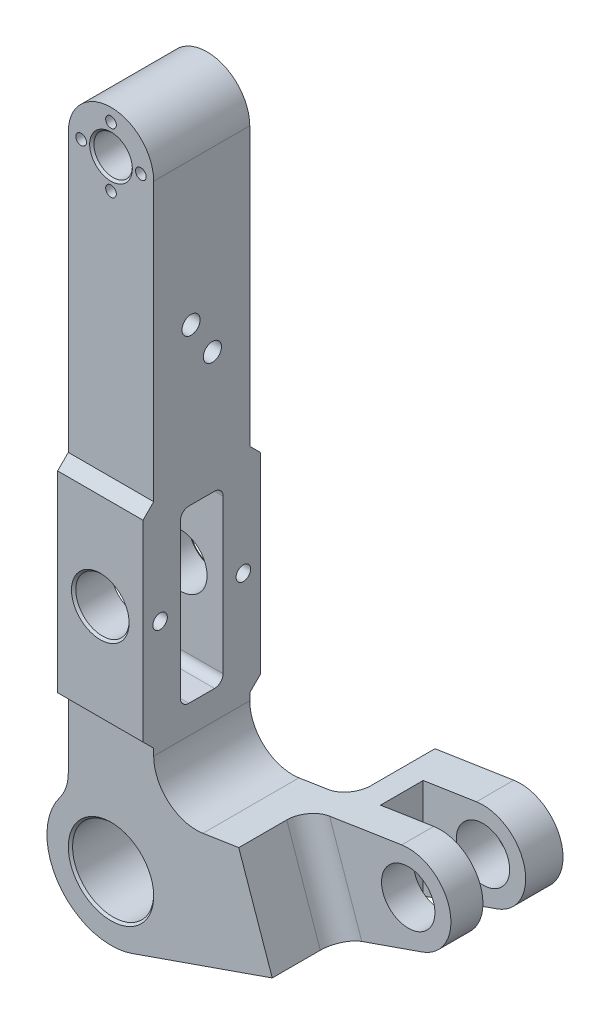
ISO-10303-21;
HEADER;
FILE_DESCRIPTION(('STEP AP214'),'2;1');
FILE_NAME('part.step','',(''),(''),'','','');
FILE_SCHEMA(('AUTOMOTIVE_DESIGN { 1 0 10303 214 1 1 1 1 }'));
ENDSEC;
DATA;
#1=APPLICATION_CONTEXT('core data for automotive mechanical design processes');
#2=APPLICATION_PROTOCOL_DEFINITION('international standard','automotive_design',2000,#1);
#3=PRODUCT_CONTEXT('',#1,'mechanical');
#4=PRODUCT('Part','Part','',(#3));
#5=PRODUCT_RELATED_PRODUCT_CATEGORY('part','',(#4));
#6=PRODUCT_DEFINITION_FORMATION('','',#4);
#7=PRODUCT_DEFINITION_CONTEXT('part definition',#1,'design');
#8=PRODUCT_DEFINITION('design','',#6,#7);
#9=PRODUCT_DEFINITION_SHAPE('','',#8);
#10=(LENGTH_UNIT() NAMED_UNIT(*) SI_UNIT(.MILLI.,.METRE.));
#11=(NAMED_UNIT(*) PLANE_ANGLE_UNIT() SI_UNIT($,.RADIAN.));
#12=(NAMED_UNIT(*) SI_UNIT($,.STERADIAN.) SOLID_ANGLE_UNIT());
#13=UNCERTAINTY_MEASURE_WITH_UNIT(LENGTH_MEASURE(1.E-05),#10,'distance_accuracy_value','');
#14=(GEOMETRIC_REPRESENTATION_CONTEXT(3) GLOBAL_UNCERTAINTY_ASSIGNED_CONTEXT((#13)) GLOBAL_UNIT_ASSIGNED_CONTEXT((#10,
#11,#12)) REPRESENTATION_CONTEXT('',''));
#15=CARTESIAN_POINT('',(0.,0.,0.));
#16=DIRECTION('',(0.,0.,1.));
#17=DIRECTION('',(1.,0.,0.));
#18=AXIS2_PLACEMENT_3D('',#15,#16,#17);
#19=CARTESIAN_POINT('',(9.87386540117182,-28.3285506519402,22.5));
#20=DIRECTION('',(-0.329128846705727,0.94428502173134,0.));
#21=DIRECTION('',(-0.94428502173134,-0.329128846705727,0.));
#22=AXIS2_PLACEMENT_3D('',#19,#20,#21);
#23=PLANE('',#22);
#24=DIRECTION('',(0.,0.,-1.));
#25=VECTOR('',#24,1.);
#26=CARTESIAN_POINT('',(113.315106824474,7.72570808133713,22.5));
#27=LINE('',#26,#25);
#28=CARTESIAN_POINT('',(113.315106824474,7.72570808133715,-10.));
#29=VERTEX_POINT('',#28);
#30=CARTESIAN_POINT('',(113.315106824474,7.72570808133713,-25.));
#31=VERTEX_POINT('',#30);
#32=EDGE_CURVE('E458',#29,#31,#27,.T.);
#33=ORIENTED_EDGE('',*,*,#32,.F.);
#34=DIRECTION('',(0.94428502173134,0.329128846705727,0.));
#35=VECTOR('',#34,1.);
#36=CARTESIAN_POINT('',(132.200807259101,14.3082850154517,-10.));
#37=LINE('',#36,#35);
#38=CARTESIAN_POINT('',(84.9865561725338,-2.14815731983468,-10.));
#39=VERTEX_POINT('',#38);
#40=EDGE_CURVE('E294',#39,#29,#37,.T.);
#41=ORIENTED_EDGE('',*,*,#40,.F.);
#42=CARTESIAN_POINT('',(84.9865561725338,-2.14815731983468,0.));
#43=DIRECTION('',(-0.329128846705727,0.94428502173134,0.));
#44=DIRECTION('',(-0.94428502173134,-0.329128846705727,0.));
#45=AXIS2_PLACEMENT_3D('',#42,#43,#44);
#46=CIRCLE('',#45,10.);
#47=CARTESIAN_POINT('',(75.5437059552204,-5.43944578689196,0.));
#48=VERTEX_POINT('',#47);
#49=EDGE_CURVE('E46',#39,#48,#46,.T.);
#50=ORIENTED_EDGE('',*,*,#49,.T.);
#51=DIRECTION('',(0.,0.,-1.));
#52=VECTOR('',#51,1.);
#53=CARTESIAN_POINT('',(75.5437059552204,-5.43944578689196,-10.));
#54=LINE('',#53,#52);
#55=CARTESIAN_POINT('',(75.5437059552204,-5.43944578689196,22.5));
#56=VERTEX_POINT('',#55);
#57=EDGE_CURVE('E282',#56,#48,#54,.T.);
#58=ORIENTED_EDGE('',*,*,#57,.F.);
#59=DIRECTION('',(0.94428502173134,0.329128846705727,0.));
#60=VECTOR('',#59,1.);
#61=CARTESIAN_POINT('',(9.87386540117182,-28.3285506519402,22.5));
#62=LINE('',#61,#60);
#63=CARTESIAN_POINT('',(9.87386540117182,-28.3285506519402,22.5));
#64=VERTEX_POINT('',#63);
#65=EDGE_CURVE('E293',#64,#56,#62,.T.);
#66=ORIENTED_EDGE('',*,*,#65,.F.);
#67=DIRECTION('',(0.,0.,-1.));
#68=VECTOR('',#67,1.);
#69=CARTESIAN_POINT('',(9.87386540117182,-28.3285506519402,22.5));
#70=LINE('',#69,#68);
#71=CARTESIAN_POINT('',(9.87386540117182,-28.3285506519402,-22.5));
#72=VERTEX_POINT('',#71);
#73=EDGE_CURVE('E708',#64,#72,#70,.T.);
#74=ORIENTED_EDGE('',*,*,#73,.T.);
#75=DIRECTION('',(0.94428502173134,0.329128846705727,0.));
#76=VECTOR('',#75,1.);
#77=CARTESIAN_POINT('',(9.87386540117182,-28.3285506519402,-22.5));
#78=LINE('',#77,#76);
#79=CARTESIAN_POINT('',(56.7325298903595,-11.9960473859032,-22.5));
#80=VERTEX_POINT('',#79);
#81=EDGE_CURVE('E697',#72,#80,#78,.T.);
#82=ORIENTED_EDGE('',*,*,#81,.T.);
#83=CARTESIAN_POINT('',(56.7325298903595,-11.9960473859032,-32.5));
#84=DIRECTION('',(-0.329128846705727,0.94428502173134,0.));
#85=DIRECTION('',(-0.94428502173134,-0.329128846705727,0.));
#86=AXIS2_PLACEMENT_3D('',#83,#84,#85);
#87=ELLIPSE('',#86,10.5900228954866,10.);
#88=CARTESIAN_POINT('',(66.7325298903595,-8.51056536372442,-32.5));
#89=VERTEX_POINT('',#88);
#90=EDGE_CURVE('E288',#80,#89,#87,.T.);
#91=ORIENTED_EDGE('',*,*,#90,.T.);
#92=DIRECTION('',(0.,0.,1.));
#93=VECTOR('',#92,1.);
#94=CARTESIAN_POINT('',(66.7325298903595,-8.51056536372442,-62.5));
#95=LINE('',#94,#93);
#96=CARTESIAN_POINT('',(66.7325298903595,-8.51056536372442,-62.5));
#97=VERTEX_POINT('',#96);
#98=EDGE_CURVE('E507',#97,#89,#95,.T.);
#99=ORIENTED_EDGE('',*,*,#98,.F.);
#100=DIRECTION('',(-0.94428502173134,-0.329128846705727,0.));
#101=VECTOR('',#100,1.);
#102=CARTESIAN_POINT('',(66.7325298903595,-8.51056536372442,-62.5));
#103=LINE('',#102,#101);
#104=CARTESIAN_POINT('',(113.315106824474,7.72570808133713,-62.5));
#105=VERTEX_POINT('',#104);
#106=EDGE_CURVE('E497',#105,#97,#103,.T.);
#107=ORIENTED_EDGE('',*,*,#106,.F.);
#108=CARTESIAN_POINT('',(113.315106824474,7.72570808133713,-45.));
#109=VERTEX_POINT('',#108);
#110=EDGE_CURVE('E703',#109,#105,#27,.T.);
#111=ORIENTED_EDGE('',*,*,#110,.F.);
#112=DIRECTION('',(-0.94428502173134,-0.329128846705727,0.));
#113=VECTOR('',#112,1.);
#114=CARTESIAN_POINT('',(113.315106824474,7.72570808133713,-45.));
#115=LINE('',#114,#113);
#116=CARTESIAN_POINT('',(78.7325298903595,-4.3279869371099,-45.));
#117=VERTEX_POINT('',#116);
#118=EDGE_CURVE('E482',#109,#117,#115,.T.);
#119=ORIENTED_EDGE('',*,*,#118,.T.);
#120=DIRECTION('',(0.,0.,-1.));
#121=VECTOR('',#120,1.);
#122=CARTESIAN_POINT('',(78.7325298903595,-4.3279869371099,-25.));
#123=LINE('',#122,#121);
#124=CARTESIAN_POINT('',(78.7325298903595,-4.3279869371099,-25.));
#125=VERTEX_POINT('',#124);
#126=EDGE_CURVE('E479',#125,#117,#123,.T.);
#127=ORIENTED_EDGE('',*,*,#126,.F.);
#128=DIRECTION('',(-0.94428502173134,-0.329128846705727,0.));
#129=VECTOR('',#128,1.);
#130=CARTESIAN_POINT('',(113.315106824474,7.72570808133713,-25.));
#131=LINE('',#130,#129);
#132=EDGE_CURVE('E469',#31,#125,#131,.T.);
#133=ORIENTED_EDGE('',*,*,#132,.F.);
#134=EDGE_LOOP('',(#33,#41,#50,#58,#66,#74,#82,#91,#99,#107,#111,#119,#127,#133));
#135=FACE_BOUND('',#134,.T.);
#136=ADVANCED_FACE('F38',(#135),#23,.F.);
#137=CARTESIAN_POINT('',(106.73252989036,26.611408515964,22.5));
#138=DIRECTION('',(0.,0.,-1.));
#139=DIRECTION('',(-1.,0.,0.));
#140=AXIS2_PLACEMENT_3D('',#137,#138,#139);
#141=CYLINDRICAL_SURFACE('',#140,20.);
#142=CARTESIAN_POINT('',(106.73252989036,26.611408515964,-10.));
#143=DIRECTION('',(0.,0.,-1.));
#144=DIRECTION('',(-1.,0.,0.));
#145=AXIS2_PLACEMENT_3D('',#142,#143,#144);
#146=CIRCLE('',#145,20.);
#147=CARTESIAN_POINT('',(103.678301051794,46.3768249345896,-10.));
#148=VERTEX_POINT('',#147);
#149=EDGE_CURVE('E463',#148,#29,#146,.T.);
#150=ORIENTED_EDGE('',*,*,#149,.T.);
#151=ORIENTED_EDGE('',*,*,#32,.T.);
#152=CARTESIAN_POINT('',(106.73252989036,26.611408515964,-25.));
#153=DIRECTION('',(0.,0.,-1.));
#154=DIRECTION('',(-1.,0.,0.));
#155=AXIS2_PLACEMENT_3D('',#152,#153,#154);
#156=CIRCLE('',#155,20.);
#157=CARTESIAN_POINT('',(103.678301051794,46.3768249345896,-25.));
#158=VERTEX_POINT('',#157);
#159=EDGE_CURVE('E466',#158,#31,#156,.T.);
#160=ORIENTED_EDGE('',*,*,#159,.F.);
#161=DIRECTION('',(0.,0.,-1.));
#162=VECTOR('',#161,1.);
#163=CARTESIAN_POINT('',(103.678301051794,46.3768249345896,22.5));
#164=LINE('',#163,#162);
#165=EDGE_CURVE('E706',#148,#158,#164,.T.);
#166=ORIENTED_EDGE('',*,*,#165,.F.);
#167=EDGE_LOOP('',(#150,#151,#160,#166));
#168=FACE_BOUND('',#167,.T.);
#169=ADVANCED_FACE('F589',(#168),#141,.T.);
#170=CARTESIAN_POINT('',(20.,33.4465291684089,22.5));
#171=DIRECTION('',(0.152711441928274,-0.988270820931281,0.));
#172=DIRECTION('',(0.988270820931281,0.152711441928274,0.));
#173=AXIS2_PLACEMENT_3D('',#170,#171,#172);
#174=PLANE('',#173);
#175=DIRECTION('',(0.,0.,-1.));
#176=VECTOR('',#175,1.);
#177=CARTESIAN_POINT('',(59.8441048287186,39.603394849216,22.5));
#178=LINE('',#177,#176);
#179=CARTESIAN_POINT('',(59.8441048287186,39.603394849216,22.5));
#180=VERTEX_POINT('',#179);
#181=CARTESIAN_POINT('',(59.8441048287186,39.603394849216,0.));
#182=VERTEX_POINT('',#181);
#183=EDGE_CURVE('E283',#180,#182,#178,.T.);
#184=ORIENTED_EDGE('',*,*,#183,.T.);
#185=CARTESIAN_POINT('',(69.8929089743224,41.1561750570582,0.));
#186=DIRECTION('',(0.152711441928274,-0.988270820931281,0.));
#187=DIRECTION('',(-0.988270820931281,-0.152711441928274,0.));
#188=AXIS2_PLACEMENT_3D('',#185,#186,#187);
#189=ELLIPSE('',#188,10.1680672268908,10.);
#190=CARTESIAN_POINT('',(69.8929089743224,41.1561750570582,-10.));
#191=VERTEX_POINT('',#190);
#192=EDGE_CURVE('E11',#182,#191,#189,.T.);
#193=ORIENTED_EDGE('',*,*,#192,.T.);
#194=DIRECTION('',(0.988270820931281,0.152711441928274,0.));
#195=VECTOR('',#194,1.);
#196=CARTESIAN_POINT('',(20.,33.4465291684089,-10.));
#197=LINE('',#196,#195);
#198=EDGE_CURVE('E446',#191,#148,#197,.T.);
#199=ORIENTED_EDGE('',*,*,#198,.T.);
#200=ORIENTED_EDGE('',*,*,#165,.T.);
#201=DIRECTION('',(0.988270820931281,0.152711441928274,0.));
#202=VECTOR('',#201,1.);
#203=CARTESIAN_POINT('',(78.7325298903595,42.5221075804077,-25.));
#204=LINE('',#203,#202);
#205=CARTESIAN_POINT('',(78.7325298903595,42.5221075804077,-25.));
#206=VERTEX_POINT('',#205);
#207=EDGE_CURVE('E476',#206,#158,#204,.T.);
#208=ORIENTED_EDGE('',*,*,#207,.F.);
#209=DIRECTION('',(0.,0.,-1.));
#210=VECTOR('',#209,1.);
#211=CARTESIAN_POINT('',(78.7325298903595,42.5221075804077,-25.));
#212=LINE('',#211,#210);
#213=CARTESIAN_POINT('',(78.7325298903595,42.5221075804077,-45.));
#214=VERTEX_POINT('',#213);
#215=EDGE_CURVE('E439',#206,#214,#212,.T.);
#216=ORIENTED_EDGE('',*,*,#215,.T.);
#217=DIRECTION('',(0.988270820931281,0.152711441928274,0.));
#218=VECTOR('',#217,1.);
#219=CARTESIAN_POINT('',(78.7325298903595,42.5221075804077,-45.));
#220=LINE('',#219,#218);
#221=CARTESIAN_POINT('',(103.678301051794,46.3768249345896,-45.));
#222=VERTEX_POINT('',#221);
#223=EDGE_CURVE('E470',#214,#222,#220,.T.);
#224=ORIENTED_EDGE('',*,*,#223,.T.);
#225=CARTESIAN_POINT('',(103.678301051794,46.3768249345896,-62.5));
#226=VERTEX_POINT('',#225);
#227=EDGE_CURVE('E303',#222,#226,#164,.T.);
#228=ORIENTED_EDGE('',*,*,#227,.T.);
#229=DIRECTION('',(0.988270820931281,0.152711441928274,0.));
#230=VECTOR('',#229,1.);
#231=CARTESIAN_POINT('',(103.678301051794,46.3768249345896,-62.5));
#232=LINE('',#231,#230);
#233=CARTESIAN_POINT('',(66.7325298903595,40.6678210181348,-62.5));
#234=VERTEX_POINT('',#233);
#235=EDGE_CURVE('E501',#234,#226,#232,.T.);
#236=ORIENTED_EDGE('',*,*,#235,.F.);
#237=DIRECTION('',(0.,0.,1.));
#238=VECTOR('',#237,1.);
#239=CARTESIAN_POINT('',(66.7325298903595,40.6678210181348,-62.5));
#240=LINE('',#239,#238);
#241=CARTESIAN_POINT('',(66.7325298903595,40.6678210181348,-32.5));
#242=VERTEX_POINT('',#241);
#243=EDGE_CURVE('E504',#234,#242,#240,.T.);
#244=ORIENTED_EDGE('',*,*,#243,.T.);
#245=CARTESIAN_POINT('',(56.7325298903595,39.1225822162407,-32.5));
#246=DIRECTION('',(0.152711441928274,-0.988270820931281,0.));
#247=DIRECTION('',(-0.988270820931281,-0.152711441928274,0.));
#248=AXIS2_PLACEMENT_3D('',#245,#246,#247);
#249=ELLIPSE('',#248,10.1186838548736,10.);
#250=CARTESIAN_POINT('',(56.7325298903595,39.1225822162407,-22.5));
#251=VERTEX_POINT('',#250);
#252=EDGE_CURVE('E432',#242,#251,#249,.T.);
#253=ORIENTED_EDGE('',*,*,#252,.T.);
#254=DIRECTION('',(-0.988270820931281,-0.152711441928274,0.));
#255=VECTOR('',#254,1.);
#256=CARTESIAN_POINT('',(20.,33.4465291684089,-22.5));
#257=LINE('',#256,#255);
#258=CARTESIAN_POINT('',(43.0542288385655,37.0089580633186,-22.5));
#259=VERTEX_POINT('',#258);
#260=EDGE_CURVE('E342',#251,#259,#257,.T.);
#261=ORIENTED_EDGE('',*,*,#260,.T.);
#262=DIRECTION('',(0.,0.,-1.));
#263=VECTOR('',#262,1.);
#264=CARTESIAN_POINT('',(43.0542288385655,37.0089580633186,22.5));
#265=LINE('',#264,#263);
#266=CARTESIAN_POINT('',(43.0542288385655,37.0089580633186,22.5));
#267=VERTEX_POINT('',#266);
#268=EDGE_CURVE('E716',#259,#267,#265,.F.);
#269=ORIENTED_EDGE('',*,*,#268,.T.);
#270=DIRECTION('',(-0.988270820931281,-0.152711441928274,0.));
#271=VECTOR('',#270,1.);
#272=CARTESIAN_POINT('',(20.,33.4465291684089,22.5));
#273=LINE('',#272,#271);
#274=EDGE_CURVE('E301',#180,#267,#273,.T.);
#275=ORIENTED_EDGE('',*,*,#274,.F.);
#276=EDGE_LOOP('',(#184,#193,#199,#200,#208,#216,#224,#228,#236,#244,#253,#261,#269,#275));
#277=FACE_BOUND('',#276,.T.);
#278=ADVANCED_FACE('F594',(#277),#174,.F.);
#279=CARTESIAN_POINT('',(106.73252989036,26.611408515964,22.5));
#280=DIRECTION('',(0.,0.,-1.));
#281=DIRECTION('',(-1.,0.,0.));
#282=AXIS2_PLACEMENT_3D('',#279,#280,#281);
#283=CYLINDRICAL_SURFACE('',#282,12.5);
#284=CARTESIAN_POINT('',(106.73252989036,26.611408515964,-10.));
#285=DIRECTION('',(0.,0.,-1.));
#286=DIRECTION('',(-1.,0.,0.));
#287=AXIS2_PLACEMENT_3D('',#284,#285,#286);
#288=CIRCLE('',#287,12.5);
#289=CARTESIAN_POINT('',(94.2325298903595,26.611408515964,-10.));
#290=VERTEX_POINT('',#289);
#291=EDGE_CURVE('E443',#290,#290,#288,.T.);
#292=CARTESIAN_POINT('',(106.73252989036,26.611408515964,-25.));
#293=DIRECTION('',(0.,0.,-1.));
#294=DIRECTION('',(-1.,0.,0.));
#295=AXIS2_PLACEMENT_3D('',#292,#293,#294);
#296=CIRCLE('',#295,12.5);
#297=CARTESIAN_POINT('',(94.2325298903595,26.611408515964,-25.));
#298=VERTEX_POINT('',#297);
#299=EDGE_CURVE('E438',#298,#298,#296,.T.);
#300=CARTESIAN_POINT('',(94.2325298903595,26.611408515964,-10.));
#301=CARTESIAN_POINT('',(94.2325298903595,26.611408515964,-10.15625));
#302=CARTESIAN_POINT('',(94.2325298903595,26.611408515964,-10.3125));
#303=CARTESIAN_POINT('',(94.2325298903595,26.611408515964,-10.625));
#304=CARTESIAN_POINT('',(94.2325298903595,26.611408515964,-10.78125));
#305=CARTESIAN_POINT('',(94.2325298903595,26.611408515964,-11.09375));
#306=CARTESIAN_POINT('',(94.2325298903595,26.611408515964,-11.25));
#307=CARTESIAN_POINT('',(94.2325298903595,26.611408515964,-11.5625));
#308=CARTESIAN_POINT('',(94.2325298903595,26.611408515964,-11.71875));
#309=CARTESIAN_POINT('',(94.2325298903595,26.611408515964,-12.03125));
#310=CARTESIAN_POINT('',(94.2325298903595,26.611408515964,-12.1875));
#311=CARTESIAN_POINT('',(94.2325298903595,26.611408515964,-12.5));
#312=CARTESIAN_POINT('',(94.2325298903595,26.611408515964,-12.65625));
#313=CARTESIAN_POINT('',(94.2325298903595,26.611408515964,-12.96875));
#314=CARTESIAN_POINT('',(94.2325298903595,26.611408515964,-13.125));
#315=CARTESIAN_POINT('',(94.2325298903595,26.611408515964,-13.4375));
#316=CARTESIAN_POINT('',(94.2325298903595,26.611408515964,-13.59375));
#317=CARTESIAN_POINT('',(94.2325298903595,26.611408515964,-13.90625));
#318=CARTESIAN_POINT('',(94.2325298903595,26.611408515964,-14.0625));
#319=CARTESIAN_POINT('',(94.2325298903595,26.611408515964,-14.375));
#320=CARTESIAN_POINT('',(94.2325298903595,26.611408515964,-14.53125));
#321=CARTESIAN_POINT('',(94.2325298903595,26.611408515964,-14.84375));
#322=CARTESIAN_POINT('',(94.2325298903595,26.611408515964,-15.));
#323=CARTESIAN_POINT('',(94.2325298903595,26.611408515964,-15.3125));
#324=CARTESIAN_POINT('',(94.2325298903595,26.611408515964,-15.46875));
#325=CARTESIAN_POINT('',(94.2325298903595,26.611408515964,-15.78125));
#326=CARTESIAN_POINT('',(94.2325298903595,26.611408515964,-15.9375));
#327=CARTESIAN_POINT('',(94.2325298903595,26.611408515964,-16.25));
#328=CARTESIAN_POINT('',(94.2325298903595,26.611408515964,-16.40625));
#329=CARTESIAN_POINT('',(94.2325298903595,26.611408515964,-16.71875));
#330=CARTESIAN_POINT('',(94.2325298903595,26.611408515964,-16.875));
#331=CARTESIAN_POINT('',(94.2325298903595,26.611408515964,-17.1875));
#332=CARTESIAN_POINT('',(94.2325298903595,26.611408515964,-17.34375));
#333=CARTESIAN_POINT('',(94.2325298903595,26.611408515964,-17.65625));
#334=CARTESIAN_POINT('',(94.2325298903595,26.611408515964,-17.8125));
#335=CARTESIAN_POINT('',(94.2325298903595,26.611408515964,-18.125));
#336=CARTESIAN_POINT('',(94.2325298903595,26.611408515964,-18.28125));
#337=CARTESIAN_POINT('',(94.2325298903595,26.611408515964,-18.59375));
#338=CARTESIAN_POINT('',(94.2325298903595,26.611408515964,-18.75));
#339=CARTESIAN_POINT('',(94.2325298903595,26.611408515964,-19.0625));
#340=CARTESIAN_POINT('',(94.2325298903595,26.611408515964,-19.21875));
#341=CARTESIAN_POINT('',(94.2325298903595,26.611408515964,-19.53125));
#342=CARTESIAN_POINT('',(94.2325298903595,26.611408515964,-19.6875));
#343=CARTESIAN_POINT('',(94.2325298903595,26.611408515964,-20.));
#344=CARTESIAN_POINT('',(94.2325298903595,26.611408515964,-20.15625));
#345=CARTESIAN_POINT('',(94.2325298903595,26.611408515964,-20.46875));
#346=CARTESIAN_POINT('',(94.2325298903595,26.611408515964,-20.625));
#347=CARTESIAN_POINT('',(94.2325298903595,26.611408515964,-20.9375));
#348=CARTESIAN_POINT('',(94.2325298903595,26.611408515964,-21.09375));
#349=CARTESIAN_POINT('',(94.2325298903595,26.611408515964,-21.40625));
#350=CARTESIAN_POINT('',(94.2325298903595,26.611408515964,-21.5625));
#351=CARTESIAN_POINT('',(94.2325298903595,26.611408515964,-21.875));
#352=CARTESIAN_POINT('',(94.2325298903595,26.611408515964,-22.03125));
#353=CARTESIAN_POINT('',(94.2325298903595,26.611408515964,-22.34375));
#354=CARTESIAN_POINT('',(94.2325298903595,26.611408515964,-22.5));
#355=CARTESIAN_POINT('',(94.2325298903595,26.611408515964,-22.8125));
#356=CARTESIAN_POINT('',(94.2325298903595,26.611408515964,-22.96875));
#357=CARTESIAN_POINT('',(94.2325298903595,26.611408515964,-23.28125));
#358=CARTESIAN_POINT('',(94.2325298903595,26.611408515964,-23.4375));
#359=CARTESIAN_POINT('',(94.2325298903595,26.611408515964,-23.75));
#360=CARTESIAN_POINT('',(94.2325298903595,26.611408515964,-23.90625));
#361=CARTESIAN_POINT('',(94.2325298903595,26.611408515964,-24.21875));
#362=CARTESIAN_POINT('',(94.2325298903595,26.611408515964,-24.375));
#363=CARTESIAN_POINT('',(94.2325298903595,26.611408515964,-24.6875));
#364=CARTESIAN_POINT('',(94.2325298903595,26.611408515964,-24.84375));
#365=CARTESIAN_POINT('',(94.2325298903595,26.611408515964,-25.));
#366=B_SPLINE_CURVE_WITH_KNOTS('',3,(#300,#301,#302,#303,#304,#305,#306,#307,#308,#309,#310,
#311,#312,#313,#314,#315,#316,#317,#318,#319,#320,#321,#322,#323,#324,#325,#326,#327,#328,#329,
#330,#331,#332,#333,#334,#335,#336,#337,#338,#339,#340,#341,#342,#343,#344,#345,#346,#347,#348,
#349,#350,#351,#352,#353,#354,#355,#356,#357,#358,#359,#360,#361,#362,#363,#364,#365),
.UNSPECIFIED.,.F.,.F.,(4,2,2,2,2,2,2,2,2,2,2,2,2,2,2,2,2,2,2,2,2,2,2,2,2,2,2,2,2,2,2,2,4),(0.,
0.468749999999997,0.937500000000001,1.40625,1.875,2.34375,2.8125,3.28125,3.75,4.21874999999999,
4.6875,5.15624999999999,5.62499999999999,6.09374999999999,6.56249999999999,7.03125,
7.49999999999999,7.96875,8.43749999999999,8.90624999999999,9.37499999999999,9.84374999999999,
10.3125,10.78125,11.25,11.71875,12.1875,12.65625,13.125,13.59375,14.0625,14.53125,15.),.UNSPECIFIED.);
#367=EDGE_CURVE('BSEAM881',#290,#298,#366,.T.);
#368=ORIENTED_EDGE('',*,*,#291,.F.);
#369=ORIENTED_EDGE('',*,*,#299,.T.);
#370=ORIENTED_EDGE('',*,*,#367,.T.);
#371=ORIENTED_EDGE('',*,*,#367,.F.);
#372=EDGE_LOOP('',(#368,#370,#369,#371));
#373=FACE_BOUND('',#372,.T.);
#374=ADVANCED_FACE('F881',(#373),#283,.F.);
#375=CARTESIAN_POINT('',(106.73252989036,26.611408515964,-22.5));
#376=DIRECTION('',(0.,0.,1.));
#377=DIRECTION('',(1.,0.,0.));
#378=AXIS2_PLACEMENT_3D('',#375,#376,#377);
#379=PLANE('',#378);
#380=CARTESIAN_POINT('',(0.,0.,-22.5));
#381=DIRECTION('',(0.,0.,1.));
#382=DIRECTION('',(1.,0.,0.));
#383=AXIS2_PLACEMENT_3D('',#380,#381,#382);
#384=CIRCLE('',#383,19.9999999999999);
#385=CARTESIAN_POINT('',(19.9999999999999,0.,-22.5));
#386=VERTEX_POINT('',#385);
#387=EDGE_CURVE('E391',#386,#386,#384,.T.);
#388=ORIENTED_EDGE('',*,*,#387,.T.);
#389=EDGE_LOOP('',(#388));
#390=FACE_BOUND('',#389,.T.);
#391=ORIENTED_EDGE('',*,*,#260,.F.);
#392=DIRECTION('',(0.,1.,0.));
#393=VECTOR('',#392,1.);
#394=CARTESIAN_POINT('',(56.7325298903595,-8.51056536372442,-22.5));
#395=LINE('',#394,#393);
#396=EDGE_CURVE('E430',#251,#80,#395,.F.);
#397=ORIENTED_EDGE('',*,*,#396,.T.);
#398=ORIENTED_EDGE('',*,*,#81,.F.);
#399=CARTESIAN_POINT('',(0.,0.,-22.5));
#400=DIRECTION('',(0.,0.,1.));
#401=DIRECTION('',(1.,0.,0.));
#402=AXIS2_PLACEMENT_3D('',#399,#400,#401);
#403=CIRCLE('',#402,30.);
#404=CARTESIAN_POINT('',(-24.,18.,-22.5));
#405=VERTEX_POINT('',#404);
#406=EDGE_CURVE('E383',#405,#72,#403,.T.);
#407=ORIENTED_EDGE('',*,*,#406,.F.);
#408=CARTESIAN_POINT('',(-40.,30.,-22.5));
#409=DIRECTION('',(0.,0.,1.));
#410=DIRECTION('',(1.,0.,0.));
#411=AXIS2_PLACEMENT_3D('',#408,#409,#410);
#412=CIRCLE('',#411,20.);
#413=CARTESIAN_POINT('',(-20.,30.,-22.5));
#414=VERTEX_POINT('',#413);
#415=EDGE_CURVE('E730',#405,#414,#412,.T.);
#416=ORIENTED_EDGE('',*,*,#415,.T.);
#417=DIRECTION('',(0.,-1.,0.));
#418=VECTOR('',#417,1.);
#419=CARTESIAN_POINT('',(-20.,22.3606797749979,-22.5));
#420=LINE('',#419,#418);
#421=CARTESIAN_POINT('',(-20.,60.,-22.5));
#422=VERTEX_POINT('',#421);
#423=EDGE_CURVE('E323',#422,#414,#420,.T.);
#424=ORIENTED_EDGE('',*,*,#423,.F.);
#425=DIRECTION('',(1.,0.,0.));
#426=VECTOR('',#425,1.);
#427=CARTESIAN_POINT('',(20.,60.,-22.5));
#428=LINE('',#427,#426);
#429=CARTESIAN_POINT('',(20.,60.,-22.5));
#430=VERTEX_POINT('',#429);
#431=EDGE_CURVE('E347',#422,#430,#428,.T.);
#432=ORIENTED_EDGE('',*,*,#431,.T.);
#433=DIRECTION('',(0.,1.,0.));
#434=VECTOR('',#433,1.);
#435=CARTESIAN_POINT('',(20.,310.,-22.5));
#436=LINE('',#435,#434);
#437=CARTESIAN_POINT('',(20.,56.7743744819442,-22.5));
#438=VERTEX_POINT('',#437);
#439=EDGE_CURVE('E319',#438,#430,#436,.T.);
#440=ORIENTED_EDGE('',*,*,#439,.F.);
#441=CARTESIAN_POINT('',(40.,56.7743744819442,-22.5));
#442=DIRECTION('',(0.,0.,1.));
#443=DIRECTION('',(1.,0.,0.));
#444=AXIS2_PLACEMENT_3D('',#441,#442,#443);
#445=CIRCLE('',#444,20.);
#446=EDGE_CURVE('E725',#438,#259,#445,.T.);
#447=ORIENTED_EDGE('',*,*,#446,.T.);
#448=EDGE_LOOP('',(#391,#397,#398,#407,#416,#424,#432,#440,#447));
#449=FACE_BOUND('',#448,.T.);
#450=ADVANCED_FACE('F613',(#390,#449),#379,.F.);
#451=CARTESIAN_POINT('',(20.,310.,22.5));
#452=DIRECTION('',(-1.,0.,0.));
#453=DIRECTION('',(0.,-1.,0.));
#454=AXIS2_PLACEMENT_3D('',#451,#452,#453);
#455=PLANE('',#454);
#456=CARTESIAN_POINT('',(20.,207.,-4.99999999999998));
#457=DIRECTION('',(1.,0.,0.));
#458=DIRECTION('',(0.,0.,-1.));
#459=AXIS2_PLACEMENT_3D('',#456,#457,#458);
#460=CIRCLE('',#459,4.25);
#461=CARTESIAN_POINT('',(20.,207.,-9.24999999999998));
#462=VERTEX_POINT('',#461);
#463=EDGE_CURVE('E513',#462,#462,#460,.T.);
#464=ORIENTED_EDGE('',*,*,#463,.F.);
#465=EDGE_LOOP('',(#464));
#466=FACE_BOUND('',#465,.T.);
#467=CARTESIAN_POINT('',(20.,223.,5.00000000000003));
#468=DIRECTION('',(1.,0.,0.));
#469=DIRECTION('',(0.,0.,-1.));
#470=AXIS2_PLACEMENT_3D('',#467,#468,#469);
#471=CIRCLE('',#470,4.24999999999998);
#472=CARTESIAN_POINT('',(20.,223.,0.750000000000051));
#473=VERTEX_POINT('',#472);
#474=EDGE_CURVE('E519',#473,#473,#471,.T.);
#475=ORIENTED_EDGE('',*,*,#474,.F.);
#476=EDGE_LOOP('',(#475));
#477=FACE_BOUND('',#476,.T.);
#478=CARTESIAN_POINT('',(20.,160.,-22.5));
#479=VERTEX_POINT('',#478);
#480=CARTESIAN_POINT('',(20.,290.,-22.5));
#481=VERTEX_POINT('',#480);
#482=EDGE_CURVE('E315',#479,#481,#436,.T.);
#483=ORIENTED_EDGE('',*,*,#482,.T.);
#484=DIRECTION('',(0.,0.,-1.));
#485=VECTOR('',#484,1.);
#486=CARTESIAN_POINT('',(20.,290.,22.5));
#487=LINE('',#486,#485);
#488=CARTESIAN_POINT('',(20.,290.,22.5));
#489=VERTEX_POINT('',#488);
#490=EDGE_CURVE('E378',#481,#489,#487,.F.);
#491=ORIENTED_EDGE('',*,*,#490,.T.);
#492=DIRECTION('',(0.,1.,0.));
#493=VECTOR('',#492,1.);
#494=CARTESIAN_POINT('',(20.,310.,22.5));
#495=LINE('',#494,#493);
#496=CARTESIAN_POINT('',(20.,160.,22.5));
#497=VERTEX_POINT('',#496);
#498=EDGE_CURVE('E331',#497,#489,#495,.T.);
#499=ORIENTED_EDGE('',*,*,#498,.F.);
#500=DIRECTION('',(0.,0.707106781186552,-0.707106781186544));
#501=VECTOR('',#500,1.);
#502=CARTESIAN_POINT('',(20.,235.000000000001,-52.5));
#503=LINE('',#502,#501);
#504=CARTESIAN_POINT('',(20.,155.,27.5));
#505=VERTEX_POINT('',#504);
#506=EDGE_CURVE('E365',#497,#505,#503,.F.);
#507=ORIENTED_EDGE('',*,*,#506,.T.);
#508=DIRECTION('',(0.,-1.,0.));
#509=VECTOR('',#508,1.);
#510=CARTESIAN_POINT('',(20.,65.,27.5));
#511=LINE('',#510,#509);
#512=CARTESIAN_POINT('',(20.,65.,27.5));
#513=VERTEX_POINT('',#512);
#514=EDGE_CURVE('E797',#505,#513,#511,.T.);
#515=ORIENTED_EDGE('',*,*,#514,.T.);
#516=DIRECTION('',(0.,0.707106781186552,0.707106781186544));
#517=VECTOR('',#516,1.);
#518=CARTESIAN_POINT('',(20.,185.000000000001,147.5));
#519=LINE('',#518,#517);
#520=CARTESIAN_POINT('',(20.,59.9999999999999,22.5));
#521=VERTEX_POINT('',#520);
#522=EDGE_CURVE('E361',#513,#521,#519,.F.);
#523=ORIENTED_EDGE('',*,*,#522,.T.);
#524=CARTESIAN_POINT('',(20.,56.7743744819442,22.5));
#525=VERTEX_POINT('',#524);
#526=EDGE_CURVE('E326',#525,#521,#495,.T.);
#527=ORIENTED_EDGE('',*,*,#526,.F.);
#528=DIRECTION('',(0.,0.,-1.));
#529=VECTOR('',#528,1.);
#530=CARTESIAN_POINT('',(20.,56.7743744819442,-22.5));
#531=LINE('',#530,#529);
#532=EDGE_CURVE('E713',#525,#438,#531,.T.);
#533=ORIENTED_EDGE('',*,*,#532,.T.);
#534=ORIENTED_EDGE('',*,*,#439,.T.);
#535=DIRECTION('',(0.,-0.707106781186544,0.707106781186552));
#536=VECTOR('',#535,1.);
#537=CARTESIAN_POINT('',(20.,162.499999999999,-125.));
#538=LINE('',#537,#536);
#539=CARTESIAN_POINT('',(20.,65.,-27.5));
#540=VERTEX_POINT('',#539);
#541=EDGE_CURVE('E372',#430,#540,#538,.F.);
#542=ORIENTED_EDGE('',*,*,#541,.T.);
#543=DIRECTION('',(0.,-1.,0.));
#544=VECTOR('',#543,1.);
#545=CARTESIAN_POINT('',(20.,65.,-27.5));
#546=LINE('',#545,#544);
#547=CARTESIAN_POINT('',(20.,155.,-27.5));
#548=VERTEX_POINT('',#547);
#549=EDGE_CURVE('E802',#548,#540,#546,.T.);
#550=ORIENTED_EDGE('',*,*,#549,.F.);
#551=DIRECTION('',(0.,-0.707106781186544,-0.707106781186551));
#552=VECTOR('',#551,1.);
#553=CARTESIAN_POINT('',(20.,257.499999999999,75.0000000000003));
#554=LINE('',#553,#552);
#555=EDGE_CURVE('E374',#548,#479,#554,.F.);
#556=ORIENTED_EDGE('',*,*,#555,.T.);
#557=EDGE_LOOP('',(#483,#491,#499,#507,#515,#523,#527,#533,#534,#542,#550,#556));
#558=FACE_BOUND('',#557,.T.);
#559=DIRECTION('',(0.,0.,1.));
#560=VECTOR('',#559,1.);
#561=CARTESIAN_POINT('',(20.,150.,-10.));
#562=LINE('',#561,#560);
#563=CARTESIAN_POINT('',(20.,150.,-6.));
#564=VERTEX_POINT('',#563);
#565=CARTESIAN_POINT('',(20.,150.,6.));
#566=VERTEX_POINT('',#565);
#567=EDGE_CURVE('E834',#564,#566,#562,.T.);
#568=ORIENTED_EDGE('',*,*,#567,.F.);
#569=CARTESIAN_POINT('',(20.,146.,-6.));
#570=DIRECTION('',(-1.,0.,0.));
#571=DIRECTION('',(0.,-1.,0.));
#572=AXIS2_PLACEMENT_3D('',#569,#570,#571);
#573=CIRCLE('',#572,4.);
#574=CARTESIAN_POINT('',(20.,146.,-10.));
#575=VERTEX_POINT('',#574);
#576=EDGE_CURVE('E763',#564,#575,#573,.T.);
#577=ORIENTED_EDGE('',*,*,#576,.T.);
#578=DIRECTION('',(0.,1.,0.));
#579=VECTOR('',#578,1.);
#580=CARTESIAN_POINT('',(20.,70.,-10.));
#581=LINE('',#580,#579);
#582=CARTESIAN_POINT('',(20.,74.,-10.));
#583=VERTEX_POINT('',#582);
#584=EDGE_CURVE('E831',#583,#575,#581,.T.);
#585=ORIENTED_EDGE('',*,*,#584,.F.);
#586=CARTESIAN_POINT('',(20.,74.,-6.));
#587=DIRECTION('',(-1.,0.,0.));
#588=DIRECTION('',(0.,-1.,0.));
#589=AXIS2_PLACEMENT_3D('',#586,#587,#588);
#590=CIRCLE('',#589,4.);
#591=CARTESIAN_POINT('',(20.,70.,-6.));
#592=VERTEX_POINT('',#591);
#593=EDGE_CURVE('E759',#583,#592,#590,.T.);
#594=ORIENTED_EDGE('',*,*,#593,.T.);
#595=DIRECTION('',(0.,0.,-1.));
#596=VECTOR('',#595,1.);
#597=CARTESIAN_POINT('',(20.,70.,-10.));
#598=LINE('',#597,#596);
#599=CARTESIAN_POINT('',(20.,70.,6.));
#600=VERTEX_POINT('',#599);
#601=EDGE_CURVE('E839',#600,#592,#598,.T.);
#602=ORIENTED_EDGE('',*,*,#601,.F.);
#603=CARTESIAN_POINT('',(20.,74.,6.));
#604=DIRECTION('',(-1.,0.,0.));
#605=DIRECTION('',(0.,-1.,0.));
#606=AXIS2_PLACEMENT_3D('',#603,#604,#605);
#607=CIRCLE('',#606,4.);
#608=CARTESIAN_POINT('',(20.,74.,10.));
#609=VERTEX_POINT('',#608);
#610=EDGE_CURVE('E755',#600,#609,#607,.T.);
#611=ORIENTED_EDGE('',*,*,#610,.T.);
#612=DIRECTION('',(0.,-1.,0.));
#613=VECTOR('',#612,1.);
#614=CARTESIAN_POINT('',(20.,70.,10.));
#615=LINE('',#614,#613);
#616=CARTESIAN_POINT('',(20.,146.,10.));
#617=VERTEX_POINT('',#616);
#618=EDGE_CURVE('E836',#617,#609,#615,.T.);
#619=ORIENTED_EDGE('',*,*,#618,.F.);
#620=CARTESIAN_POINT('',(20.,146.,6.));
#621=DIRECTION('',(-1.,0.,0.));
#622=DIRECTION('',(0.,-1.,0.));
#623=AXIS2_PLACEMENT_3D('',#620,#621,#622);
#624=CIRCLE('',#623,4.);
#625=EDGE_CURVE('E766',#617,#566,#624,.T.);
#626=ORIENTED_EDGE('',*,*,#625,.T.);
#627=EDGE_LOOP('',(#568,#577,#585,#594,#602,#611,#619,#626));
#628=FACE_BOUND('',#627,.T.);
#629=CARTESIAN_POINT('',(20.,110.,-19.5));
#630=DIRECTION('',(1.,0.,0.));
#631=DIRECTION('',(0.,0.,-1.));
#632=AXIS2_PLACEMENT_3D('',#629,#630,#631);
#633=CIRCLE('',#632,3.39999999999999);
#634=CARTESIAN_POINT('',(20.,110.,-22.9));
#635=VERTEX_POINT('',#634);
#636=EDGE_CURVE('E533',#635,#635,#633,.T.);
#637=ORIENTED_EDGE('',*,*,#636,.F.);
#638=EDGE_LOOP('',(#637));
#639=FACE_BOUND('',#638,.T.);
#640=CARTESIAN_POINT('',(20.,110.,19.5));
#641=DIRECTION('',(1.,0.,0.));
#642=DIRECTION('',(0.,0.,-1.));
#643=AXIS2_PLACEMENT_3D('',#640,#641,#642);
#644=CIRCLE('',#643,3.39999999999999);
#645=CARTESIAN_POINT('',(20.,110.,16.1));
#646=VERTEX_POINT('',#645);
#647=EDGE_CURVE('E522',#646,#646,#644,.T.);
#648=ORIENTED_EDGE('',*,*,#647,.F.);
#649=EDGE_LOOP('',(#648));
#650=FACE_BOUND('',#649,.T.);
#651=ADVANCED_FACE('F609',(#466,#477,#558,#628,#639,#650),#455,.F.);
#652=CARTESIAN_POINT('',(0.,290.,-22.5));
#653=DIRECTION('',(0.,0.,-1.));
#654=DIRECTION('',(-1.,0.,0.));
#655=AXIS2_PLACEMENT_3D('',#652,#653,#654);
#656=CYLINDRICAL_SURFACE('',#655,20.);
#657=ORIENTED_EDGE('',*,*,#490,.F.);
#658=CARTESIAN_POINT('',(0.,290.,-22.5));
#659=DIRECTION('',(0.,0.,1.));
#660=DIRECTION('',(1.,0.,0.));
#661=AXIS2_PLACEMENT_3D('',#658,#659,#660);
#662=CIRCLE('',#661,20.);
#663=CARTESIAN_POINT('',(-20.,290.,-22.5));
#664=VERTEX_POINT('',#663);
#665=EDGE_CURVE('E387',#664,#481,#662,.F.);
#666=ORIENTED_EDGE('',*,*,#665,.F.);
#667=DIRECTION('',(0.,0.,-1.));
#668=VECTOR('',#667,1.);
#669=CARTESIAN_POINT('',(-20.,290.,22.5));
#670=LINE('',#669,#668);
#671=CARTESIAN_POINT('',(-20.,290.,22.5));
#672=VERTEX_POINT('',#671);
#673=EDGE_CURVE('E381',#672,#664,#670,.T.);
#674=ORIENTED_EDGE('',*,*,#673,.F.);
#675=CARTESIAN_POINT('',(0.,290.,22.5));
#676=DIRECTION('',(0.,0.,1.));
#677=DIRECTION('',(1.,0.,0.));
#678=AXIS2_PLACEMENT_3D('',#675,#676,#677);
#679=CIRCLE('',#678,20.);
#680=EDGE_CURVE('E389',#489,#672,#679,.T.);
#681=ORIENTED_EDGE('',*,*,#680,.F.);
#682=EDGE_LOOP('',(#657,#666,#674,#681));
#683=FACE_BOUND('',#682,.T.);
#684=ADVANCED_FACE('F612',(#683),#656,.T.);
#685=CARTESIAN_POINT('',(106.73252989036,26.611408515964,22.5));
#686=DIRECTION('',(0.,0.,1.));
#687=DIRECTION('',(1.,0.,0.));
#688=AXIS2_PLACEMENT_3D('',#685,#686,#687);
#689=PLANE('',#688);
#690=DIRECTION('',(0.329128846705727,-0.94428502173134,0.));
#691=VECTOR('',#690,1.);
#692=CARTESIAN_POINT('',(68.9611290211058,13.4462546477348,22.5));
#693=LINE('',#692,#691);
#694=EDGE_CURVE('E280',#180,#56,#693,.T.);
#695=ORIENTED_EDGE('',*,*,#694,.F.);
#696=ORIENTED_EDGE('',*,*,#274,.T.);
#697=CARTESIAN_POINT('',(40.,56.7743744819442,22.5));
#698=DIRECTION('',(0.,0.,1.));
#699=DIRECTION('',(1.,0.,0.));
#700=AXIS2_PLACEMENT_3D('',#697,#698,#699);
#701=CIRCLE('',#700,20.);
#702=EDGE_CURVE('E728',#267,#525,#701,.F.);
#703=ORIENTED_EDGE('',*,*,#702,.T.);
#704=ORIENTED_EDGE('',*,*,#526,.T.);
#705=DIRECTION('',(-1.,0.,0.));
#706=VECTOR('',#705,1.);
#707=CARTESIAN_POINT('',(-20.,59.9999999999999,22.5));
#708=LINE('',#707,#706);
#709=CARTESIAN_POINT('',(-20.,59.9999999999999,22.5));
#710=VERTEX_POINT('',#709);
#711=EDGE_CURVE('E343',#521,#710,#708,.T.);
#712=ORIENTED_EDGE('',*,*,#711,.T.);
#713=DIRECTION('',(0.,-1.,0.));
#714=VECTOR('',#713,1.);
#715=CARTESIAN_POINT('',(-20.,22.3606797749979,22.5));
#716=LINE('',#715,#714);
#717=CARTESIAN_POINT('',(-20.,30.,22.5));
#718=VERTEX_POINT('',#717);
#719=EDGE_CURVE('E330',#710,#718,#716,.T.);
#720=ORIENTED_EDGE('',*,*,#719,.T.);
#721=CARTESIAN_POINT('',(-40.,30.,22.5));
#722=DIRECTION('',(0.,0.,1.));
#723=DIRECTION('',(1.,0.,0.));
#724=AXIS2_PLACEMENT_3D('',#721,#722,#723);
#725=CIRCLE('',#724,20.);
#726=CARTESIAN_POINT('',(-24.,18.,22.5));
#727=VERTEX_POINT('',#726);
#728=EDGE_CURVE('E733',#718,#727,#725,.F.);
#729=ORIENTED_EDGE('',*,*,#728,.T.);
#730=CARTESIAN_POINT('',(0.,0.,22.5));
#731=DIRECTION('',(0.,0.,1.));
#732=DIRECTION('',(1.,0.,0.));
#733=AXIS2_PLACEMENT_3D('',#730,#731,#732);
#734=CIRCLE('',#733,30.);
#735=EDGE_CURVE('E299',#727,#64,#734,.T.);
#736=ORIENTED_EDGE('',*,*,#735,.T.);
#737=ORIENTED_EDGE('',*,*,#65,.T.);
#738=EDGE_LOOP('',(#695,#696,#703,#704,#712,#720,#729,#736,#737));
#739=FACE_BOUND('',#738,.T.);
#740=CARTESIAN_POINT('',(0.,0.,22.5));
#741=DIRECTION('',(0.,0.,1.));
#742=DIRECTION('',(1.,0.,0.));
#743=AXIS2_PLACEMENT_3D('',#740,#741,#742);
#744=CIRCLE('',#743,20.0000000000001);
#745=CARTESIAN_POINT('',(20.0000000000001,0.,22.5));
#746=VERTEX_POINT('',#745);
#747=EDGE_CURVE('E406',#746,#746,#744,.F.);
#748=ORIENTED_EDGE('',*,*,#747,.T.);
#749=EDGE_LOOP('',(#748));
#750=FACE_BOUND('',#749,.T.);
#751=ADVANCED_FACE('F296',(#739,#750),#689,.T.);
#752=CARTESIAN_POINT('',(0.,290.,22.5));
#753=DIRECTION('',(0.,0.,1.));
#754=DIRECTION('',(1.,0.,0.));
#755=AXIS2_PLACEMENT_3D('',#752,#753,#754);
#756=CIRCLE('',#755,10.0000000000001);
#757=CARTESIAN_POINT('',(10.0000000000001,290.,22.5));
#758=VERTEX_POINT('',#757);
#759=EDGE_CURVE('E421',#758,#758,#756,.F.);
#760=ORIENTED_EDGE('',*,*,#759,.T.);
#761=EDGE_LOOP('',(#760));
#762=FACE_BOUND('',#761,.T.);
#763=CARTESIAN_POINT('',(14.,290.,22.5));
#764=DIRECTION('',(0.,0.,1.));
#765=DIRECTION('',(0.,-1.,0.));
#766=AXIS2_PLACEMENT_3D('',#763,#764,#765);
#767=CIRCLE('',#766,2.5);
#768=CARTESIAN_POINT('',(14.,287.5,22.5));
#769=VERTEX_POINT('',#768);
#770=EDGE_CURVE('E1392',#769,#769,#767,.T.);
#771=ORIENTED_EDGE('',*,*,#770,.F.);
#772=EDGE_LOOP('',(#771));
#773=FACE_BOUND('',#772,.T.);
#774=CARTESIAN_POINT('',(0.,276.,22.5));
#775=DIRECTION('',(0.,0.,1.));
#776=DIRECTION('',(-1.,0.,0.));
#777=AXIS2_PLACEMENT_3D('',#774,#775,#776);
#778=CIRCLE('',#777,2.5);
#779=CARTESIAN_POINT('',(-2.4999999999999,276.,22.5));
#780=VERTEX_POINT('',#779);
#781=EDGE_CURVE('E1398',#780,#780,#778,.T.);
#782=ORIENTED_EDGE('',*,*,#781,.F.);
#783=EDGE_LOOP('',(#782));
#784=FACE_BOUND('',#783,.T.);
#785=CARTESIAN_POINT('',(-14.,290.,22.5));
#786=DIRECTION('',(0.,0.,1.));
#787=DIRECTION('',(0.,1.,0.));
#788=AXIS2_PLACEMENT_3D('',#785,#786,#787);
#789=CIRCLE('',#788,2.5);
#790=CARTESIAN_POINT('',(-14.,292.5,22.5));
#791=VERTEX_POINT('',#790);
#792=EDGE_CURVE('E1404',#791,#791,#789,.T.);
#793=ORIENTED_EDGE('',*,*,#792,.F.);
#794=EDGE_LOOP('',(#793));
#795=FACE_BOUND('',#794,.T.);
#796=CARTESIAN_POINT('',(0.,304.,22.5));
#797=DIRECTION('',(0.,0.,1.));
#798=DIRECTION('',(1.,0.,0.));
#799=AXIS2_PLACEMENT_3D('',#796,#797,#798);
#800=CIRCLE('',#799,2.5);
#801=CARTESIAN_POINT('',(2.5,304.,22.5));
#802=VERTEX_POINT('',#801);
#803=EDGE_CURVE('E1413',#802,#802,#800,.T.);
#804=ORIENTED_EDGE('',*,*,#803,.F.);
#805=EDGE_LOOP('',(#804));
#806=FACE_BOUND('',#805,.T.);
#807=ORIENTED_EDGE('',*,*,#498,.T.);
#808=ORIENTED_EDGE('',*,*,#680,.T.);
#809=CARTESIAN_POINT('',(-20.,160.,22.5));
#810=VERTEX_POINT('',#809);
#811=EDGE_CURVE('E305',#672,#810,#716,.T.);
#812=ORIENTED_EDGE('',*,*,#811,.T.);
#813=DIRECTION('',(1.,0.,0.));
#814=VECTOR('',#813,1.);
#815=CARTESIAN_POINT('',(20.,160.,22.5));
#816=LINE('',#815,#814);
#817=EDGE_CURVE('E344',#810,#497,#816,.T.);
#818=ORIENTED_EDGE('',*,*,#817,.T.);
#819=EDGE_LOOP('',(#807,#808,#812,#818));
#820=FACE_BOUND('',#819,.T.);
#821=ADVANCED_FACE('F891',(#762,#773,#784,#795,#806,#820),#689,.T.);
#822=CARTESIAN_POINT('',(0.,290.,-22.5));
#823=DIRECTION('',(0.,0.,1.));
#824=DIRECTION('',(1.,0.,0.));
#825=AXIS2_PLACEMENT_3D('',#822,#823,#824);
#826=CIRCLE('',#825,10.);
#827=CARTESIAN_POINT('',(10.,290.,-22.5));
#828=VERTEX_POINT('',#827);
#829=EDGE_CURVE('E424',#828,#828,#826,.T.);
#830=ORIENTED_EDGE('',*,*,#829,.T.);
#831=EDGE_LOOP('',(#830));
#832=FACE_BOUND('',#831,.T.);
#833=CARTESIAN_POINT('',(-20.,160.,-22.5));
#834=VERTEX_POINT('',#833);
#835=EDGE_CURVE('E348',#664,#834,#420,.T.);
#836=ORIENTED_EDGE('',*,*,#835,.F.);
#837=ORIENTED_EDGE('',*,*,#665,.T.);
#838=ORIENTED_EDGE('',*,*,#482,.F.);
#839=DIRECTION('',(-1.,0.,0.));
#840=VECTOR('',#839,1.);
#841=CARTESIAN_POINT('',(-20.,160.,-22.5));
#842=LINE('',#841,#840);
#843=EDGE_CURVE('E349',#479,#834,#842,.T.);
#844=ORIENTED_EDGE('',*,*,#843,.T.);
#845=EDGE_LOOP('',(#836,#837,#838,#844));
#846=FACE_BOUND('',#845,.T.);
#847=ADVANCED_FACE('F848',(#832,#846),#379,.F.);
#848=CARTESIAN_POINT('',(0.,110.,22.5));
#849=DIRECTION('',(0.,0.,-1.));
#850=DIRECTION('',(-1.,0.,0.));
#851=AXIS2_PLACEMENT_3D('',#848,#849,#850);
#852=CYLINDRICAL_SURFACE('',#851,12.5);
#853=CARTESIAN_POINT('',(0.,110.,-26.4999999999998));
#854=DIRECTION('',(0.,0.,1.));
#855=DIRECTION('',(1.,0.,0.));
#856=AXIS2_PLACEMENT_3D('',#853,#854,#855);
#857=CIRCLE('',#856,12.5);
#858=CARTESIAN_POINT('',(12.5,110.,-26.4999999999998));
#859=VERTEX_POINT('',#858);
#860=EDGE_CURVE('E400',#859,#859,#857,.F.);
#861=ORIENTED_EDGE('',*,*,#860,.T.);
#862=EDGE_LOOP('',(#861));
#863=FACE_BOUND('',#862,.T.);
#864=CARTESIAN_POINT('',(12.5,110.,-22.9));
#865=CARTESIAN_POINT('',(12.4999973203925,109.812706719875,-22.8999958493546));
#866=CARTESIAN_POINT('',(12.4957492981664,109.625369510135,-22.884472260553));
#867=CARTESIAN_POINT('',(12.4792159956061,109.25610081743,-22.8229036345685));
#868=CARTESIAN_POINT('',(12.4669270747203,109.074171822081,-22.7768447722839));
#869=CARTESIAN_POINT('',(12.4356668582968,108.721102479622,-22.6558206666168));
#870=CARTESIAN_POINT('',(12.416704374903,108.549948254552,-22.5808935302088));
#871=CARTESIAN_POINT('',(12.3740959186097,108.222634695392,-22.4044033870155));
#872=CARTESIAN_POINT('',(12.3504495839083,108.066476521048,-22.3028383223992));
#873=CARTESIAN_POINT('',(12.3003860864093,107.769833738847,-22.0733781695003));
#874=CARTESIAN_POINT('',(12.2739200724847,107.629760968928,-21.9449613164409));
#875=CARTESIAN_POINT('',(12.2215102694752,107.372850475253,-21.6665576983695));
#876=CARTESIAN_POINT('',(12.1955665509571,107.2560158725,-21.516568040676));
#877=CARTESIAN_POINT('',(12.1466365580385,107.046866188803,-21.1959591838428));
#878=CARTESIAN_POINT('',(12.1237117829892,106.955029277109,-21.0250177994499));
#879=CARTESIAN_POINT('',(12.0841354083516,106.801563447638,-20.6693959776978));
#880=CARTESIAN_POINT('',(12.0674826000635,106.739928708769,-20.484718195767));
#881=CARTESIAN_POINT('',(12.0428407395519,106.650055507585,-20.1114372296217));
#882=CARTESIAN_POINT('',(12.0346578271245,106.621068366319,-19.9230274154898));
#883=CARTESIAN_POINT('',(12.0273034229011,106.594978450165,-19.5438550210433));
#884=CARTESIAN_POINT('',(12.0281301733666,106.597869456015,-19.3530929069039));
#885=CARTESIAN_POINT('',(12.0385284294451,106.634860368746,-18.980510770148));
#886=CARTESIAN_POINT('',(12.047844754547,106.668049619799,-18.7985920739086));
#887=CARTESIAN_POINT('',(12.0737632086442,106.763234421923,-18.4430078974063));
#888=CARTESIAN_POINT('',(12.0903659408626,106.825232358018,-18.2693431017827));
#889=CARTESIAN_POINT('',(12.1292076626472,106.977005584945,-17.9328452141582));
#890=CARTESIAN_POINT('',(12.151510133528,107.067096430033,-17.7701620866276));
#891=CARTESIAN_POINT('',(12.1992048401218,107.272278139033,-17.4619048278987));
#892=CARTESIAN_POINT('',(12.2245977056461,107.387374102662,-17.3163341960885));
#893=CARTESIAN_POINT('',(12.2766701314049,107.643934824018,-17.0412366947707));
#894=CARTESIAN_POINT('',(12.3033640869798,107.786162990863,-16.9124234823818));
#895=CARTESIAN_POINT('',(12.3542582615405,108.090530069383,-16.6803276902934));
#896=CARTESIAN_POINT('',(12.3784583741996,108.252669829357,-16.5770461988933));
#897=CARTESIAN_POINT('',(12.4217971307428,108.593391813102,-16.3986137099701));
#898=CARTESIAN_POINT('',(12.440911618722,108.772047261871,-16.323596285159));
#899=CARTESIAN_POINT('',(12.4717510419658,109.140073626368,-16.2048690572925));
#900=CARTESIAN_POINT('',(12.4834776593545,109.329442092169,-16.1611521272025));
#901=CARTESIAN_POINT('',(12.497963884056,109.707432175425,-16.107397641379));
#902=CARTESIAN_POINT('',(12.5009816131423,109.895906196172,-16.0963903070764));
#903=CARTESIAN_POINT('',(12.4984544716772,110.272008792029,-16.1056832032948));
#904=CARTESIAN_POINT('',(12.4929105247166,110.459637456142,-16.1259800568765));
#905=CARTESIAN_POINT('',(12.4740500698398,110.825231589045,-16.1965112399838));
#906=CARTESIAN_POINT('',(12.4608751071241,111.00331014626,-16.2462007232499));
#907=CARTESIAN_POINT('',(12.4282509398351,111.348583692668,-16.3734704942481));
#908=CARTESIAN_POINT('',(12.4088010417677,111.51577747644,-16.4510538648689));
#909=CARTESIAN_POINT('',(12.3651843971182,111.838273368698,-16.6336814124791));
#910=CARTESIAN_POINT('',(12.3409304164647,111.993267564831,-16.7392479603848));
#911=CARTESIAN_POINT('',(12.2905071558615,112.28368031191,-16.9741920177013));
#912=CARTESIAN_POINT('',(12.264337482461,112.419094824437,-17.1035744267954));
#913=CARTESIAN_POINT('',(12.2120760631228,112.670619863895,-17.3870094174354));
#914=CARTESIAN_POINT('',(12.1860092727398,112.786045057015,-17.5416759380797));
#915=CARTESIAN_POINT('',(12.1377471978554,112.989322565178,-17.8687378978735));
#916=CARTESIAN_POINT('',(12.1155517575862,113.077175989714,-18.0411326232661));
#917=CARTESIAN_POINT('',(12.0778026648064,113.222157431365,-18.3979300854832));
#918=CARTESIAN_POINT('',(12.0622113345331,113.279460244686,-18.5822575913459));
#919=CARTESIAN_POINT('',(12.0394398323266,113.362106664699,-18.9584312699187));
#920=CARTESIAN_POINT('',(12.032257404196,113.387458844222,-19.1502754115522));
#921=CARTESIAN_POINT('',(12.027310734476,113.404976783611,-19.5290052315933));
#922=CARTESIAN_POINT('',(12.0292332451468,113.398246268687,-19.7158365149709));
#923=CARTESIAN_POINT('',(12.0415434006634,113.354361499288,-20.0855924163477));
#924=CARTESIAN_POINT('',(12.0519308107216,113.31720808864,-20.2685171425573));
#925=CARTESIAN_POINT('',(12.0798101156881,113.214183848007,-20.6238151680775));
#926=CARTESIAN_POINT('',(12.097241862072,113.148555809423,-20.7962639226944));
#927=CARTESIAN_POINT('',(12.137245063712,112.990633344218,-21.1278353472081));
#928=CARTESIAN_POINT('',(12.1598173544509,112.898334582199,-21.2869558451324));
#929=CARTESIAN_POINT('',(12.2084187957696,112.686383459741,-21.5926002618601));
#930=CARTESIAN_POINT('',(12.2345324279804,112.5659822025,-21.7385914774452));
#931=CARTESIAN_POINT('',(12.2868125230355,112.302656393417,-22.0086559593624));
#932=CARTESIAN_POINT('',(12.3129789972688,112.159726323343,-22.1327238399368));
#933=CARTESIAN_POINT('',(12.363121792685,111.85151543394,-22.358173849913));
#934=CARTESIAN_POINT('',(12.3870354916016,111.685803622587,-22.4589819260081));
#935=CARTESIAN_POINT('',(12.4292842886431,111.339138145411,-22.6311516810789));
#936=CARTESIAN_POINT('',(12.4476228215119,111.158193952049,-22.7025314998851));
#937=CARTESIAN_POINT('',(12.4743987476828,110.815040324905,-22.8049438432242));
#938=CARTESIAN_POINT('',(12.4839278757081,110.654253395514,-22.8405051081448));
#939=CARTESIAN_POINT('',(12.4967293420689,110.328988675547,-22.8880337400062));
#940=CARTESIAN_POINT('',(12.5000023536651,110.164511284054,-22.9000036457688));
#941=CARTESIAN_POINT('',(12.5,110.,-22.9));
#942=B_SPLINE_CURVE_WITH_KNOTS('',3,(#864,#865,#866,#867,#868,#869,#870,#871,#872,#873,#874,
#875,#876,#877,#878,#879,#880,#881,#882,#883,#884,#885,#886,#887,#888,#889,#890,#891,#892,#893,
#894,#895,#896,#897,#898,#899,#900,#901,#902,#903,#904,#905,#906,#907,#908,#909,#910,#911,#912,
#913,#914,#915,#916,#917,#918,#919,#920,#921,#922,#923,#924,#925,#926,#927,#928,#929,#930,#931,
#932,#933,#934,#935,#936,#937,#938,#939,#940,#941),.UNSPECIFIED.,.T.,.F.,(4,2,2,2,2,2,2,2,2,2,2,
2,2,2,2,2,2,2,2,2,2,2,2,2,2,2,2,2,2,2,2,2,2,2,2,2,2,2,4),(0.,0.561276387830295,1.12280707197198,
1.68359904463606,2.2444343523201,2.81739450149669,3.39043155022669,3.97376258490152,
4.55698114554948,5.12653414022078,5.69597602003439,6.24884662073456,6.80176300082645,
7.36112847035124,7.92060812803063,8.49910771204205,9.07763195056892,9.65885691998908,
10.2399495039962,10.8036328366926,11.3672553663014,11.9207437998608,12.4742934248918,
13.0390092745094,13.6038414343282,14.1852951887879,14.7667255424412,15.3447925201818,
15.9227043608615,16.4808809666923,17.039042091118,17.5925347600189,18.1461174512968,
18.7165964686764,19.2872154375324,19.8706897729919,20.4538039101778,20.9468607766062,
21.4398645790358),.UNSPECIFIED.);
#943=CARTESIAN_POINT('',(12.5,110.,-22.9));
#944=VERTEX_POINT('',#943);
#945=EDGE_CURVE('E1386',#944,#944,#942,.T.);
#946=ORIENTED_EDGE('',*,*,#945,.F.);
#947=EDGE_LOOP('',(#946));
#948=FACE_BOUND('',#947,.T.);
#949=CARTESIAN_POINT('',(0.,110.,-10.));
#950=DIRECTION('',(0.,0.,-1.));
#951=DIRECTION('',(0.,1.,0.));
#952=AXIS2_PLACEMENT_3D('',#949,#950,#951);
#953=CIRCLE('',#952,12.5);
#954=CARTESIAN_POINT('',(0.,122.5,-10.));
#955=VERTEX_POINT('',#954);
#956=EDGE_CURVE('E828',#955,#955,#953,.F.);
#957=ORIENTED_EDGE('',*,*,#956,.T.);
#958=EDGE_LOOP('',(#957));
#959=FACE_BOUND('',#958,.T.);
#960=ADVANCED_FACE('F607',(#863,#948,#959),#852,.F.);
#961=CARTESIAN_POINT('',(-20.,22.3606797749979,22.5));
#962=DIRECTION('',(1.,0.,0.));
#963=DIRECTION('',(0.,0.,-1.));
#964=AXIS2_PLACEMENT_3D('',#961,#962,#963);
#965=PLANE('',#964);
#966=DIRECTION('',(0.,0.,1.));
#967=VECTOR('',#966,1.);
#968=CARTESIAN_POINT('',(-20.,70.,-10.));
#969=LINE('',#968,#967);
#970=CARTESIAN_POINT('',(-20.,70.,-6.));
#971=VERTEX_POINT('',#970);
#972=CARTESIAN_POINT('',(-20.,70.,6.));
#973=VERTEX_POINT('',#972);
#974=EDGE_CURVE('E822',#971,#973,#969,.T.);
#975=ORIENTED_EDGE('',*,*,#974,.F.);
#976=CARTESIAN_POINT('',(-20.,74.,-6.));
#977=DIRECTION('',(1.,0.,0.));
#978=DIRECTION('',(0.,0.,-1.));
#979=AXIS2_PLACEMENT_3D('',#976,#977,#978);
#980=CIRCLE('',#979,4.);
#981=CARTESIAN_POINT('',(-20.,74.,-10.));
#982=VERTEX_POINT('',#981);
#983=EDGE_CURVE('E761',#971,#982,#980,.T.);
#984=ORIENTED_EDGE('',*,*,#983,.T.);
#985=DIRECTION('',(0.,-1.,0.));
#986=VECTOR('',#985,1.);
#987=CARTESIAN_POINT('',(-20.,70.,-10.));
#988=LINE('',#987,#986);
#989=CARTESIAN_POINT('',(-20.,146.,-10.));
#990=VERTEX_POINT('',#989);
#991=EDGE_CURVE('E825',#990,#982,#988,.T.);
#992=ORIENTED_EDGE('',*,*,#991,.F.);
#993=CARTESIAN_POINT('',(-20.,146.,-6.));
#994=DIRECTION('',(1.,0.,0.));
#995=DIRECTION('',(0.,0.,-1.));
#996=AXIS2_PLACEMENT_3D('',#993,#994,#995);
#997=CIRCLE('',#996,4.);
#998=CARTESIAN_POINT('',(-20.,150.,-6.));
#999=VERTEX_POINT('',#998);
#1000=EDGE_CURVE('E765',#990,#999,#997,.T.);
#1001=ORIENTED_EDGE('',*,*,#1000,.T.);
#1002=DIRECTION('',(0.,0.,-1.));
#1003=VECTOR('',#1002,1.);
#1004=CARTESIAN_POINT('',(-20.,150.,-10.));
#1005=LINE('',#1004,#1003);
#1006=CARTESIAN_POINT('',(-20.,150.,6.));
#1007=VERTEX_POINT('',#1006);
#1008=EDGE_CURVE('E841',#1007,#999,#1005,.T.);
#1009=ORIENTED_EDGE('',*,*,#1008,.F.);
#1010=CARTESIAN_POINT('',(-20.,146.,6.));
#1011=DIRECTION('',(1.,0.,0.));
#1012=DIRECTION('',(0.,0.,-1.));
#1013=AXIS2_PLACEMENT_3D('',#1010,#1011,#1012);
#1014=CIRCLE('',#1013,4.);
#1015=CARTESIAN_POINT('',(-20.,146.,10.));
#1016=VERTEX_POINT('',#1015);
#1017=EDGE_CURVE('E324',#1007,#1016,#1014,.T.);
#1018=ORIENTED_EDGE('',*,*,#1017,.T.);
#1019=DIRECTION('',(0.,1.,0.));
#1020=VECTOR('',#1019,1.);
#1021=CARTESIAN_POINT('',(-20.,70.,10.));
#1022=LINE('',#1021,#1020);
#1023=CARTESIAN_POINT('',(-20.,74.,10.));
#1024=VERTEX_POINT('',#1023);
#1025=EDGE_CURVE('E820',#1024,#1016,#1022,.T.);
#1026=ORIENTED_EDGE('',*,*,#1025,.F.);
#1027=CARTESIAN_POINT('',(-20.,74.,6.));
#1028=DIRECTION('',(1.,0.,0.));
#1029=DIRECTION('',(0.,0.,-1.));
#1030=AXIS2_PLACEMENT_3D('',#1027,#1028,#1029);
#1031=CIRCLE('',#1030,4.);
#1032=EDGE_CURVE('E757',#1024,#973,#1031,.T.);
#1033=ORIENTED_EDGE('',*,*,#1032,.T.);
#1034=EDGE_LOOP('',(#975,#984,#992,#1001,#1009,#1018,#1026,#1033));
#1035=FACE_BOUND('',#1034,.T.);
#1036=ORIENTED_EDGE('',*,*,#811,.F.);
#1037=ORIENTED_EDGE('',*,*,#673,.T.);
#1038=ORIENTED_EDGE('',*,*,#835,.T.);
#1039=DIRECTION('',(0.,0.707106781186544,0.707106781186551));
#1040=VECTOR('',#1039,1.);
#1041=CARTESIAN_POINT('',(-20.,113.6803398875,-68.8196601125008));
#1042=LINE('',#1041,#1040);
#1043=CARTESIAN_POINT('',(-20.,155.,-27.5));
#1044=VERTEX_POINT('',#1043);
#1045=EDGE_CURVE('E376',#834,#1044,#1042,.F.);
#1046=ORIENTED_EDGE('',*,*,#1045,.T.);
#1047=DIRECTION('',(0.,1.,0.));
#1048=VECTOR('',#1047,1.);
#1049=CARTESIAN_POINT('',(-20.,155.,-27.5));
#1050=LINE('',#1049,#1048);
#1051=CARTESIAN_POINT('',(-20.,65.,-27.5));
#1052=VERTEX_POINT('',#1051);
#1053=EDGE_CURVE('E814',#1052,#1044,#1050,.T.);
#1054=ORIENTED_EDGE('',*,*,#1053,.F.);
#1055=DIRECTION('',(0.,0.707106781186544,-0.707106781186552));
#1056=VECTOR('',#1055,1.);
#1057=CARTESIAN_POINT('',(-20.,18.6803398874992,18.8196601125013));
#1058=LINE('',#1057,#1056);
#1059=EDGE_CURVE('E370',#1052,#422,#1058,.F.);
#1060=ORIENTED_EDGE('',*,*,#1059,.T.);
#1061=ORIENTED_EDGE('',*,*,#423,.T.);
#1062=DIRECTION('',(0.,0.,1.));
#1063=VECTOR('',#1062,1.);
#1064=CARTESIAN_POINT('',(-20.,30.,22.5));
#1065=LINE('',#1064,#1063);
#1066=EDGE_CURVE('E722',#414,#718,#1065,.T.);
#1067=ORIENTED_EDGE('',*,*,#1066,.T.);
#1068=ORIENTED_EDGE('',*,*,#719,.F.);
#1069=DIRECTION('',(0.,-0.707106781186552,-0.707106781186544));
#1070=VECTOR('',#1069,1.);
#1071=CARTESIAN_POINT('',(-20.,41.1803398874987,3.68033988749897));
#1072=LINE('',#1071,#1070);
#1073=CARTESIAN_POINT('',(-20.,65.,27.5));
#1074=VERTEX_POINT('',#1073);
#1075=EDGE_CURVE('E355',#710,#1074,#1072,.F.);
#1076=ORIENTED_EDGE('',*,*,#1075,.T.);
#1077=DIRECTION('',(0.,1.,0.));
#1078=VECTOR('',#1077,1.);
#1079=CARTESIAN_POINT('',(-20.,155.,27.5));
#1080=LINE('',#1079,#1078);
#1081=CARTESIAN_POINT('',(-20.,155.,27.5));
#1082=VERTEX_POINT('',#1081);
#1083=EDGE_CURVE('E803',#1074,#1082,#1080,.T.);
#1084=ORIENTED_EDGE('',*,*,#1083,.T.);
#1085=DIRECTION('',(0.,-0.707106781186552,0.707106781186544));
#1086=VECTOR('',#1085,1.);
#1087=CARTESIAN_POINT('',(-20.,91.1803398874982,91.3196601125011));
#1088=LINE('',#1087,#1086);
#1089=EDGE_CURVE('E367',#1082,#810,#1088,.F.);
#1090=ORIENTED_EDGE('',*,*,#1089,.T.);
#1091=EDGE_LOOP('',(#1036,#1037,#1038,#1046,#1054,#1060,#1061,#1067,#1068,#1076,#1084,#1090));
#1092=FACE_BOUND('',#1091,.T.);
#1093=ADVANCED_FACE('F603',(#1035,#1092),#965,.F.);
#1094=CARTESIAN_POINT('',(0.,0.,22.5));
#1095=DIRECTION('',(0.,0.,-1.));
#1096=DIRECTION('',(-1.,0.,0.));
#1097=AXIS2_PLACEMENT_3D('',#1094,#1095,#1096);
#1098=CYLINDRICAL_SURFACE('',#1097,30.);
#1099=ORIENTED_EDGE('',*,*,#735,.F.);
#1100=DIRECTION('',(0.,0.,-1.));
#1101=VECTOR('',#1100,1.);
#1102=CARTESIAN_POINT('',(-24.,18.,22.5));
#1103=LINE('',#1102,#1101);
#1104=EDGE_CURVE('E719',#727,#405,#1103,.T.);
#1105=ORIENTED_EDGE('',*,*,#1104,.T.);
#1106=ORIENTED_EDGE('',*,*,#406,.T.);
#1107=ORIENTED_EDGE('',*,*,#73,.F.);
#1108=EDGE_LOOP('',(#1099,#1105,#1106,#1107));
#1109=FACE_BOUND('',#1108,.T.);
#1110=ADVANCED_FACE('F600',(#1109),#1098,.T.);
#1111=ORIENTED_EDGE('',*,*,#227,.F.);
#1112=CARTESIAN_POINT('',(106.73252989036,26.611408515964,-45.));
#1113=DIRECTION('',(0.,0.,-1.));
#1114=DIRECTION('',(-1.,0.,0.));
#1115=AXIS2_PLACEMENT_3D('',#1112,#1113,#1114);
#1116=CIRCLE('',#1115,20.);
#1117=EDGE_CURVE('E465',#222,#109,#1116,.T.);
#1118=ORIENTED_EDGE('',*,*,#1117,.T.);
#1119=ORIENTED_EDGE('',*,*,#110,.T.);
#1120=CARTESIAN_POINT('',(106.73252989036,26.611408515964,-62.5));
#1121=DIRECTION('',(0.,0.,-1.));
#1122=DIRECTION('',(-1.,0.,0.));
#1123=AXIS2_PLACEMENT_3D('',#1120,#1121,#1122);
#1124=CIRCLE('',#1123,20.);
#1125=EDGE_CURVE('E494',#226,#105,#1124,.T.);
#1126=ORIENTED_EDGE('',*,*,#1125,.F.);
#1127=EDGE_LOOP('',(#1111,#1118,#1119,#1126));
#1128=FACE_BOUND('',#1127,.T.);
#1129=ADVANCED_FACE('F597',(#1128),#141,.T.);
#1130=CARTESIAN_POINT('',(0.,0.,22.5));
#1131=DIRECTION('',(0.,0.,-1.));
#1132=DIRECTION('',(-1.,0.,0.));
#1133=AXIS2_PLACEMENT_3D('',#1130,#1131,#1132);
#1134=CYLINDRICAL_SURFACE('',#1133,19.);
#1135=CARTESIAN_POINT('',(0.,0.,-21.5000000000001));
#1136=DIRECTION('',(0.,0.,1.));
#1137=DIRECTION('',(1.,0.,0.));
#1138=AXIS2_PLACEMENT_3D('',#1135,#1136,#1137);
#1139=CIRCLE('',#1138,19.);
#1140=CARTESIAN_POINT('',(-19.,0.,-21.5000000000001));
#1141=VERTEX_POINT('',#1140);
#1142=EDGE_CURVE('E397',#1141,#1141,#1139,.F.);
#1143=CARTESIAN_POINT('',(0.,0.,21.4999999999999));
#1144=DIRECTION('',(0.,0.,1.));
#1145=DIRECTION('',(1.,0.,0.));
#1146=AXIS2_PLACEMENT_3D('',#1143,#1144,#1145);
#1147=CIRCLE('',#1146,19.);
#1148=CARTESIAN_POINT('',(-19.,0.,21.4999999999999));
#1149=VERTEX_POINT('',#1148);
#1150=EDGE_CURVE('E394',#1149,#1149,#1147,.T.);
#1151=CARTESIAN_POINT('',(-19.,0.,-21.5000000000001));
#1152=CARTESIAN_POINT('',(-19.,0.,-21.0520833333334));
#1153=CARTESIAN_POINT('',(-19.,0.,-20.6041666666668));
#1154=CARTESIAN_POINT('',(-19.,0.,-19.7083333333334));
#1155=CARTESIAN_POINT('',(-19.,0.,-19.2604166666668));
#1156=CARTESIAN_POINT('',(-19.,0.,-18.3645833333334));
#1157=CARTESIAN_POINT('',(-19.,0.,-17.9166666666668));
#1158=CARTESIAN_POINT('',(-19.,0.,-17.0208333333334));
#1159=CARTESIAN_POINT('',(-19.,0.,-16.5729166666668));
#1160=CARTESIAN_POINT('',(-19.,0.,-15.6770833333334));
#1161=CARTESIAN_POINT('',(-19.,0.,-15.2291666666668));
#1162=CARTESIAN_POINT('',(-19.,0.,-14.3333333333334));
#1163=CARTESIAN_POINT('',(-19.,0.,-13.8854166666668));
#1164=CARTESIAN_POINT('',(-19.,0.,-12.9895833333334));
#1165=CARTESIAN_POINT('',(-19.,0.,-12.5416666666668));
#1166=CARTESIAN_POINT('',(-19.,0.,-11.6458333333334));
#1167=CARTESIAN_POINT('',(-19.,0.,-11.1979166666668));
#1168=CARTESIAN_POINT('',(-19.,0.,-10.3020833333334));
#1169=CARTESIAN_POINT('',(-19.,0.,-9.85416666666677));
#1170=CARTESIAN_POINT('',(-19.,0.,-8.95833333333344));
#1171=CARTESIAN_POINT('',(-19.,0.,-8.51041666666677));
#1172=CARTESIAN_POINT('',(-19.,0.,-7.61458333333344));
#1173=CARTESIAN_POINT('',(-19.,0.,-7.16666666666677));
#1174=CARTESIAN_POINT('',(-19.,0.,-6.27083333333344));
#1175=CARTESIAN_POINT('',(-19.,0.,-5.82291666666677));
#1176=CARTESIAN_POINT('',(-19.,0.,-4.92708333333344));
#1177=CARTESIAN_POINT('',(-19.,0.,-4.47916666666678));
#1178=CARTESIAN_POINT('',(-19.,0.,-3.58333333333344));
#1179=CARTESIAN_POINT('',(-19.,0.,-3.13541666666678));
#1180=CARTESIAN_POINT('',(-19.,0.,-2.23958333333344));
#1181=CARTESIAN_POINT('',(-19.,0.,-1.79166666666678));
#1182=CARTESIAN_POINT('',(-19.,0.,-0.895833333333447));
#1183=CARTESIAN_POINT('',(-19.,0.,-0.44791666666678));
#1184=CARTESIAN_POINT('',(-19.,0.,0.447916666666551));
#1185=CARTESIAN_POINT('',(-19.,0.,0.895833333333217));
#1186=CARTESIAN_POINT('',(-19.,0.,1.79166666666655));
#1187=CARTESIAN_POINT('',(-19.,0.,2.23958333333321));
#1188=CARTESIAN_POINT('',(-19.,0.,3.13541666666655));
#1189=CARTESIAN_POINT('',(-19.,0.,3.58333333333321));
#1190=CARTESIAN_POINT('',(-19.,0.,4.47916666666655));
#1191=CARTESIAN_POINT('',(-19.,0.,4.92708333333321));
#1192=CARTESIAN_POINT('',(-19.,0.,5.82291666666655));
#1193=CARTESIAN_POINT('',(-19.,0.,6.27083333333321));
#1194=CARTESIAN_POINT('',(-19.,0.,7.16666666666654));
#1195=CARTESIAN_POINT('',(-19.,0.,7.61458333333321));
#1196=CARTESIAN_POINT('',(-19.,0.,8.51041666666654));
#1197=CARTESIAN_POINT('',(-19.,0.,8.95833333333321));
#1198=CARTESIAN_POINT('',(-19.,0.,9.85416666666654));
#1199=CARTESIAN_POINT('',(-19.,0.,10.3020833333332));
#1200=CARTESIAN_POINT('',(-19.,0.,11.1979166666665));
#1201=CARTESIAN_POINT('',(-19.,0.,11.6458333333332));
#1202=CARTESIAN_POINT('',(-19.,0.,12.5416666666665));
#1203=CARTESIAN_POINT('',(-19.,0.,12.9895833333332));
#1204=CARTESIAN_POINT('',(-19.,0.,13.8854166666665));
#1205=CARTESIAN_POINT('',(-19.,0.,14.3333333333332));
#1206=CARTESIAN_POINT('',(-19.,0.,15.2291666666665));
#1207=CARTESIAN_POINT('',(-19.,0.,15.6770833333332));
#1208=CARTESIAN_POINT('',(-19.,0.,16.5729166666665));
#1209=CARTESIAN_POINT('',(-19.,0.,17.0208333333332));
#1210=CARTESIAN_POINT('',(-19.,0.,17.9166666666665));
#1211=CARTESIAN_POINT('',(-19.,0.,18.3645833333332));
#1212=CARTESIAN_POINT('',(-19.,0.,19.2604166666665));
#1213=CARTESIAN_POINT('',(-19.,0.,19.7083333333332));
#1214=CARTESIAN_POINT('',(-19.,0.,20.6041666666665));
#1215=CARTESIAN_POINT('',(-19.,0.,21.0520833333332));
#1216=CARTESIAN_POINT('',(-19.,0.,21.4999999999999));
#1217=B_SPLINE_CURVE_WITH_KNOTS('',3,(#1151,#1152,#1153,#1154,#1155,#1156,#1157,#1158,#1159,
#1160,#1161,#1162,#1163,#1164,#1165,#1166,#1167,#1168,#1169,#1170,#1171,#1172,#1173,#1174,#1175,
#1176,#1177,#1178,#1179,#1180,#1181,#1182,#1183,#1184,#1185,#1186,#1187,#1188,#1189,#1190,#1191,
#1192,#1193,#1194,#1195,#1196,#1197,#1198,#1199,#1200,#1201,#1202,#1203,#1204,#1205,#1206,#1207,
#1208,#1209,#1210,#1211,#1212,#1213,#1214,#1215,#1216),.UNSPECIFIED.,.F.,.F.,(4,2,2,2,2,2,2,2,2,
2,2,2,2,2,2,2,2,2,2,2,2,2,2,2,2,2,2,2,2,2,2,2,4),(0.,1.34375,2.6875,4.03124999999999,
5.37499999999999,6.71875,8.06249999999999,9.40624999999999,10.75,12.09375,13.4375,14.78125,
16.125,17.46875,18.8125,20.15625,21.5,22.84375,24.1875,25.53125,26.875,28.21875,29.5625,
30.90625,32.25,33.59375,34.9375,36.28125,37.625,38.96875,40.3125,41.65625,43.),.UNSPECIFIED.);
#1218=EDGE_CURVE('BSEAM884',#1141,#1149,#1217,.T.);
#1219=ORIENTED_EDGE('',*,*,#1142,.T.);
#1220=ORIENTED_EDGE('',*,*,#1150,.T.);
#1221=ORIENTED_EDGE('',*,*,#1218,.T.);
#1222=ORIENTED_EDGE('',*,*,#1218,.F.);
#1223=EDGE_LOOP('',(#1219,#1221,#1220,#1222));
#1224=FACE_BOUND('',#1223,.T.);
#1225=ADVANCED_FACE('F884',(#1224),#1134,.F.);
#1226=CARTESIAN_POINT('',(0.,110.,26.5000000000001));
#1227=DIRECTION('',(0.,0.,-1.));
#1228=DIRECTION('',(-1.,0.,0.));
#1229=AXIS2_PLACEMENT_3D('',#1226,#1227,#1228);
#1230=CIRCLE('',#1229,12.5);
#1231=CARTESIAN_POINT('',(-12.5,110.,26.5000000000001));
#1232=VERTEX_POINT('',#1231);
#1233=EDGE_CURVE('E412',#1232,#1232,#1230,.F.);
#1234=ORIENTED_EDGE('',*,*,#1233,.T.);
#1235=EDGE_LOOP('',(#1234));
#1236=FACE_BOUND('',#1235,.T.);
#1237=CARTESIAN_POINT('',(12.5,110.,16.1));
#1238=CARTESIAN_POINT('',(12.4999973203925,109.812706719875,16.1000041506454));
#1239=CARTESIAN_POINT('',(12.4957492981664,109.625369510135,16.115527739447));
#1240=CARTESIAN_POINT('',(12.4792159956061,109.25610081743,16.1770963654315));
#1241=CARTESIAN_POINT('',(12.4669270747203,109.074171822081,16.2231552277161));
#1242=CARTESIAN_POINT('',(12.4356668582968,108.721102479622,16.3441793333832));
#1243=CARTESIAN_POINT('',(12.416704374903,108.549948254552,16.4191064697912));
#1244=CARTESIAN_POINT('',(12.3740959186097,108.222634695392,16.5955966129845));
#1245=CARTESIAN_POINT('',(12.3504495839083,108.066476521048,16.6971616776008));
#1246=CARTESIAN_POINT('',(12.3003860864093,107.769833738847,16.9266218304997));
#1247=CARTESIAN_POINT('',(12.2739200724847,107.629760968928,17.0550386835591));
#1248=CARTESIAN_POINT('',(12.2215102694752,107.372850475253,17.3334423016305));
#1249=CARTESIAN_POINT('',(12.1955665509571,107.2560158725,17.483431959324));
#1250=CARTESIAN_POINT('',(12.1466365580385,107.046866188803,17.8040408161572));
#1251=CARTESIAN_POINT('',(12.1237117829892,106.955029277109,17.9749822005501));
#1252=CARTESIAN_POINT('',(12.0841354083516,106.801563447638,18.3306040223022));
#1253=CARTESIAN_POINT('',(12.0674826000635,106.739928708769,18.515281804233));
#1254=CARTESIAN_POINT('',(12.0428407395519,106.650055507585,18.8885627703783));
#1255=CARTESIAN_POINT('',(12.0346578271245,106.621068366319,19.0769725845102));
#1256=CARTESIAN_POINT('',(12.0273034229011,106.594978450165,19.4561449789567));
#1257=CARTESIAN_POINT('',(12.0281301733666,106.597869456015,19.6469070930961));
#1258=CARTESIAN_POINT('',(12.0385284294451,106.634860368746,20.019489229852));
#1259=CARTESIAN_POINT('',(12.047844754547,106.668049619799,20.2014079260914));
#1260=CARTESIAN_POINT('',(12.0737632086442,106.763234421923,20.5569921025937));
#1261=CARTESIAN_POINT('',(12.0903659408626,106.825232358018,20.7306568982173));
#1262=CARTESIAN_POINT('',(12.1292076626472,106.977005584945,21.0671547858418));
#1263=CARTESIAN_POINT('',(12.151510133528,107.067096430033,21.2298379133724));
#1264=CARTESIAN_POINT('',(12.1992048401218,107.272278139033,21.5380951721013));
#1265=CARTESIAN_POINT('',(12.2245977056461,107.387374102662,21.6836658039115));
#1266=CARTESIAN_POINT('',(12.2766701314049,107.643934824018,21.9587633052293));
#1267=CARTESIAN_POINT('',(12.3033640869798,107.786162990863,22.0875765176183));
#1268=CARTESIAN_POINT('',(12.3542582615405,108.090530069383,22.3196723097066));
#1269=CARTESIAN_POINT('',(12.3784583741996,108.252669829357,22.4229538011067));
#1270=CARTESIAN_POINT('',(12.4217971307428,108.593391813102,22.6013862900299));
#1271=CARTESIAN_POINT('',(12.440911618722,108.772047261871,22.676403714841));
#1272=CARTESIAN_POINT('',(12.4717510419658,109.140073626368,22.7951309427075));
#1273=CARTESIAN_POINT('',(12.4834776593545,109.329442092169,22.8388478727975));
#1274=CARTESIAN_POINT('',(12.497963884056,109.707432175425,22.892602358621));
#1275=CARTESIAN_POINT('',(12.5009816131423,109.895906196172,22.9036096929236));
#1276=CARTESIAN_POINT('',(12.4984544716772,110.272008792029,22.8943167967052));
#1277=CARTESIAN_POINT('',(12.4929105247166,110.459637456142,22.8740199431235));
#1278=CARTESIAN_POINT('',(12.4740500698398,110.825231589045,22.8034887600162));
#1279=CARTESIAN_POINT('',(12.4608751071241,111.00331014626,22.7537992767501));
#1280=CARTESIAN_POINT('',(12.4282509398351,111.348583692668,22.6265295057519));
#1281=CARTESIAN_POINT('',(12.4088010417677,111.51577747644,22.5489461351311));
#1282=CARTESIAN_POINT('',(12.3651843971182,111.838273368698,22.3663185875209));
#1283=CARTESIAN_POINT('',(12.3409304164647,111.993267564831,22.2607520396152));
#1284=CARTESIAN_POINT('',(12.2905071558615,112.28368031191,22.0258079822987));
#1285=CARTESIAN_POINT('',(12.264337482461,112.419094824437,21.8964255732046));
#1286=CARTESIAN_POINT('',(12.2120760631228,112.670619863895,21.6129905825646));
#1287=CARTESIAN_POINT('',(12.1860092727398,112.786045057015,21.4583240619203));
#1288=CARTESIAN_POINT('',(12.1377471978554,112.989322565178,21.1312621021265));
#1289=CARTESIAN_POINT('',(12.1155517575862,113.077175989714,20.9588673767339));
#1290=CARTESIAN_POINT('',(12.0778026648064,113.222157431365,20.6020699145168));
#1291=CARTESIAN_POINT('',(12.0622113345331,113.279460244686,20.4177424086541));
#1292=CARTESIAN_POINT('',(12.0394398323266,113.362106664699,20.0415687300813));
#1293=CARTESIAN_POINT('',(12.032257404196,113.387458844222,19.8497245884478));
#1294=CARTESIAN_POINT('',(12.027310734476,113.404976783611,19.4709947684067));
#1295=CARTESIAN_POINT('',(12.0292332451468,113.398246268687,19.2841634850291));
#1296=CARTESIAN_POINT('',(12.0415434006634,113.354361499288,18.9144075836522));
#1297=CARTESIAN_POINT('',(12.0519308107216,113.31720808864,18.7314828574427));
#1298=CARTESIAN_POINT('',(12.0798101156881,113.214183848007,18.3761848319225));
#1299=CARTESIAN_POINT('',(12.097241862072,113.148555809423,18.2037360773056));
#1300=CARTESIAN_POINT('',(12.137245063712,112.990633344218,17.8721646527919));
#1301=CARTESIAN_POINT('',(12.1598173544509,112.898334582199,17.7130441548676));
#1302=CARTESIAN_POINT('',(12.2084187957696,112.686383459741,17.4073997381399));
#1303=CARTESIAN_POINT('',(12.2345324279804,112.5659822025,17.2614085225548));
#1304=CARTESIAN_POINT('',(12.2868125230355,112.302656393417,16.9913440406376));
#1305=CARTESIAN_POINT('',(12.3129789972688,112.159726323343,16.8672761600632));
#1306=CARTESIAN_POINT('',(12.363121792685,111.85151543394,16.641826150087));
#1307=CARTESIAN_POINT('',(12.3870354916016,111.685803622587,16.5410180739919));
#1308=CARTESIAN_POINT('',(12.4292842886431,111.339138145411,16.3688483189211));
#1309=CARTESIAN_POINT('',(12.4476228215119,111.158193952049,16.2974685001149));
#1310=CARTESIAN_POINT('',(12.4743987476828,110.815040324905,16.1950561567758));
#1311=CARTESIAN_POINT('',(12.4839278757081,110.654253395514,16.1594948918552));
#1312=CARTESIAN_POINT('',(12.4967293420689,110.328988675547,16.1119662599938));
#1313=CARTESIAN_POINT('',(12.5000023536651,110.164511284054,16.0999963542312));
#1314=CARTESIAN_POINT('',(12.5,110.,16.1));
#1315=B_SPLINE_CURVE_WITH_KNOTS('',3,(#1237,#1238,#1239,#1240,#1241,#1242,#1243,#1244,#1245,
#1246,#1247,#1248,#1249,#1250,#1251,#1252,#1253,#1254,#1255,#1256,#1257,#1258,#1259,#1260,#1261,
#1262,#1263,#1264,#1265,#1266,#1267,#1268,#1269,#1270,#1271,#1272,#1273,#1274,#1275,#1276,#1277,
#1278,#1279,#1280,#1281,#1282,#1283,#1284,#1285,#1286,#1287,#1288,#1289,#1290,#1291,#1292,#1293,
#1294,#1295,#1296,#1297,#1298,#1299,#1300,#1301,#1302,#1303,#1304,#1305,#1306,#1307,#1308,#1309,
#1310,#1311,#1312,#1313,#1314),.UNSPECIFIED.,.T.,.F.,(4,2,2,2,2,2,2,2,2,2,2,2,2,2,2,2,2,2,2,2,2,
2,2,2,2,2,2,2,2,2,2,2,2,2,2,2,2,2,4),(0.,0.561276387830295,1.12280707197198,1.68359904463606,
2.2444343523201,2.81739450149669,3.39043155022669,3.97376258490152,4.55698114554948,
5.12653414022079,5.69597602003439,6.24884662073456,6.80176300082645,7.36112847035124,
7.92060812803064,8.49910771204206,9.07763195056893,9.6588569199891,10.2399495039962,
10.8036328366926,11.3672553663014,11.9207437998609,12.4742934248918,13.0390092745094,
13.6038414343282,14.1852951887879,14.7667255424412,15.3447925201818,15.9227043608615,
16.4808809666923,17.039042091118,17.5925347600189,18.1461174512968,18.7165964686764,
19.2872154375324,19.8706897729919,20.4538039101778,20.9468607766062,21.4398645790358),.UNSPECIFIED.);
#1316=CARTESIAN_POINT('',(12.5,110.,16.1));
#1317=VERTEX_POINT('',#1316);
#1318=EDGE_CURVE('E525',#1317,#1317,#1315,.T.);
#1319=ORIENTED_EDGE('',*,*,#1318,.F.);
#1320=EDGE_LOOP('',(#1319));
#1321=FACE_BOUND('',#1320,.T.);
#1322=CARTESIAN_POINT('',(0.,110.,10.));
#1323=DIRECTION('',(0.,0.,1.));
#1324=DIRECTION('',(0.,-1.,0.));
#1325=AXIS2_PLACEMENT_3D('',#1322,#1323,#1324);
#1326=CIRCLE('',#1325,12.5);
#1327=CARTESIAN_POINT('',(0.,97.5,10.));
#1328=VERTEX_POINT('',#1327);
#1329=EDGE_CURVE('E335',#1328,#1328,#1326,.F.);
#1330=ORIENTED_EDGE('',*,*,#1329,.T.);
#1331=EDGE_LOOP('',(#1330));
#1332=FACE_BOUND('',#1331,.T.);
#1333=ADVANCED_FACE('F879',(#1236,#1321,#1332),#852,.F.);
#1334=CARTESIAN_POINT('',(106.73252989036,26.611408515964,-45.));
#1335=DIRECTION('',(0.,0.,-1.));
#1336=DIRECTION('',(-1.,0.,0.));
#1337=AXIS2_PLACEMENT_3D('',#1334,#1335,#1336);
#1338=CIRCLE('',#1337,12.5);
#1339=CARTESIAN_POINT('',(94.2325298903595,26.611408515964,-45.));
#1340=VERTEX_POINT('',#1339);
#1341=EDGE_CURVE('E435',#1340,#1340,#1338,.T.);
#1342=CARTESIAN_POINT('',(106.73252989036,26.611408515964,-62.5));
#1343=DIRECTION('',(0.,0.,-1.));
#1344=DIRECTION('',(-1.,0.,0.));
#1345=AXIS2_PLACEMENT_3D('',#1342,#1343,#1344);
#1346=CIRCLE('',#1345,12.5);
#1347=CARTESIAN_POINT('',(94.2325298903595,26.611408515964,-62.5));
#1348=VERTEX_POINT('',#1347);
#1349=EDGE_CURVE('E441',#1348,#1348,#1346,.T.);
#1350=CARTESIAN_POINT('',(94.2325298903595,26.611408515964,-45.));
#1351=CARTESIAN_POINT('',(94.2325298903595,26.611408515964,-45.1822916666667));
#1352=CARTESIAN_POINT('',(94.2325298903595,26.611408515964,-45.3645833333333));
#1353=CARTESIAN_POINT('',(94.2325298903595,26.611408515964,-45.7291666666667));
#1354=CARTESIAN_POINT('',(94.2325298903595,26.611408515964,-45.9114583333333));
#1355=CARTESIAN_POINT('',(94.2325298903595,26.611408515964,-46.2760416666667));
#1356=CARTESIAN_POINT('',(94.2325298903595,26.611408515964,-46.4583333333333));
#1357=CARTESIAN_POINT('',(94.2325298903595,26.611408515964,-46.8229166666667));
#1358=CARTESIAN_POINT('',(94.2325298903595,26.611408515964,-47.0052083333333));
#1359=CARTESIAN_POINT('',(94.2325298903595,26.611408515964,-47.3697916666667));
#1360=CARTESIAN_POINT('',(94.2325298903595,26.611408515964,-47.5520833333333));
#1361=CARTESIAN_POINT('',(94.2325298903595,26.611408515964,-47.9166666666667));
#1362=CARTESIAN_POINT('',(94.2325298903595,26.611408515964,-48.0989583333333));
#1363=CARTESIAN_POINT('',(94.2325298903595,26.611408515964,-48.4635416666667));
#1364=CARTESIAN_POINT('',(94.2325298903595,26.611408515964,-48.6458333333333));
#1365=CARTESIAN_POINT('',(94.2325298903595,26.611408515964,-49.0104166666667));
#1366=CARTESIAN_POINT('',(94.2325298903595,26.611408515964,-49.1927083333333));
#1367=CARTESIAN_POINT('',(94.2325298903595,26.611408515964,-49.5572916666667));
#1368=CARTESIAN_POINT('',(94.2325298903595,26.611408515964,-49.7395833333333));
#1369=CARTESIAN_POINT('',(94.2325298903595,26.611408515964,-50.1041666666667));
#1370=CARTESIAN_POINT('',(94.2325298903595,26.611408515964,-50.2864583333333));
#1371=CARTESIAN_POINT('',(94.2325298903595,26.611408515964,-50.6510416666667));
#1372=CARTESIAN_POINT('',(94.2325298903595,26.611408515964,-50.8333333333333));
#1373=CARTESIAN_POINT('',(94.2325298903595,26.611408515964,-51.1979166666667));
#1374=CARTESIAN_POINT('',(94.2325298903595,26.611408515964,-51.3802083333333));
#1375=CARTESIAN_POINT('',(94.2325298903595,26.611408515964,-51.7447916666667));
#1376=CARTESIAN_POINT('',(94.2325298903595,26.611408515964,-51.9270833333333));
#1377=CARTESIAN_POINT('',(94.2325298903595,26.611408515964,-52.2916666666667));
#1378=CARTESIAN_POINT('',(94.2325298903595,26.611408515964,-52.4739583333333));
#1379=CARTESIAN_POINT('',(94.2325298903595,26.611408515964,-52.8385416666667));
#1380=CARTESIAN_POINT('',(94.2325298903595,26.611408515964,-53.0208333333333));
#1381=CARTESIAN_POINT('',(94.2325298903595,26.611408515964,-53.3854166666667));
#1382=CARTESIAN_POINT('',(94.2325298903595,26.611408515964,-53.5677083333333));
#1383=CARTESIAN_POINT('',(94.2325298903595,26.611408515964,-53.9322916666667));
#1384=CARTESIAN_POINT('',(94.2325298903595,26.611408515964,-54.1145833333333));
#1385=CARTESIAN_POINT('',(94.2325298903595,26.611408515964,-54.4791666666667));
#1386=CARTESIAN_POINT('',(94.2325298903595,26.611408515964,-54.6614583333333));
#1387=CARTESIAN_POINT('',(94.2325298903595,26.611408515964,-55.0260416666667));
#1388=CARTESIAN_POINT('',(94.2325298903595,26.611408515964,-55.2083333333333));
#1389=CARTESIAN_POINT('',(94.2325298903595,26.611408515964,-55.5729166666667));
#1390=CARTESIAN_POINT('',(94.2325298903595,26.611408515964,-55.7552083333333));
#1391=CARTESIAN_POINT('',(94.2325298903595,26.611408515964,-56.1197916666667));
#1392=CARTESIAN_POINT('',(94.2325298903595,26.611408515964,-56.3020833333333));
#1393=CARTESIAN_POINT('',(94.2325298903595,26.611408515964,-56.6666666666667));
#1394=CARTESIAN_POINT('',(94.2325298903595,26.611408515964,-56.8489583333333));
#1395=CARTESIAN_POINT('',(94.2325298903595,26.611408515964,-57.2135416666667));
#1396=CARTESIAN_POINT('',(94.2325298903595,26.611408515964,-57.3958333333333));
#1397=CARTESIAN_POINT('',(94.2325298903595,26.611408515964,-57.7604166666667));
#1398=CARTESIAN_POINT('',(94.2325298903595,26.611408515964,-57.9427083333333));
#1399=CARTESIAN_POINT('',(94.2325298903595,26.611408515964,-58.3072916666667));
#1400=CARTESIAN_POINT('',(94.2325298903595,26.611408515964,-58.4895833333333));
#1401=CARTESIAN_POINT('',(94.2325298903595,26.611408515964,-58.8541666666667));
#1402=CARTESIAN_POINT('',(94.2325298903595,26.611408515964,-59.0364583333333));
#1403=CARTESIAN_POINT('',(94.2325298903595,26.611408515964,-59.4010416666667));
#1404=CARTESIAN_POINT('',(94.2325298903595,26.611408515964,-59.5833333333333));
#1405=CARTESIAN_POINT('',(94.2325298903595,26.611408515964,-59.9479166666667));
#1406=CARTESIAN_POINT('',(94.2325298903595,26.611408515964,-60.1302083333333));
#1407=CARTESIAN_POINT('',(94.2325298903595,26.611408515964,-60.4947916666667));
#1408=CARTESIAN_POINT('',(94.2325298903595,26.611408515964,-60.6770833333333));
#1409=CARTESIAN_POINT('',(94.2325298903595,26.611408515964,-61.0416666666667));
#1410=CARTESIAN_POINT('',(94.2325298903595,26.611408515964,-61.2239583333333));
#1411=CARTESIAN_POINT('',(94.2325298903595,26.611408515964,-61.5885416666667));
#1412=CARTESIAN_POINT('',(94.2325298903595,26.611408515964,-61.7708333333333));
#1413=CARTESIAN_POINT('',(94.2325298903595,26.611408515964,-62.1354166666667));
#1414=CARTESIAN_POINT('',(94.2325298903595,26.611408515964,-62.3177083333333));
#1415=CARTESIAN_POINT('',(94.2325298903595,26.611408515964,-62.5));
#1416=B_SPLINE_CURVE_WITH_KNOTS('',3,(#1350,#1351,#1352,#1353,#1354,#1355,#1356,#1357,#1358,
#1359,#1360,#1361,#1362,#1363,#1364,#1365,#1366,#1367,#1368,#1369,#1370,#1371,#1372,#1373,#1374,
#1375,#1376,#1377,#1378,#1379,#1380,#1381,#1382,#1383,#1384,#1385,#1386,#1387,#1388,#1389,#1390,
#1391,#1392,#1393,#1394,#1395,#1396,#1397,#1398,#1399,#1400,#1401,#1402,#1403,#1404,#1405,#1406,
#1407,#1408,#1409,#1410,#1411,#1412,#1413,#1414,#1415),.UNSPECIFIED.,.F.,.F.,(4,2,2,2,2,2,2,2,2,
2,2,2,2,2,2,2,2,2,2,2,2,2,2,2,2,2,2,2,2,2,2,2,4),(0.,0.546875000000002,1.09375,1.64062500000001,
2.18750000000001,2.734375,3.28125,3.828125,4.375,4.92187500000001,5.46875000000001,
6.01562500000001,6.5625,7.109375,7.65625,8.20312500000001,8.75000000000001,9.29687500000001,
9.84375000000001,10.390625,10.9375,11.484375,12.03125,12.578125,13.125,13.671875,14.21875,
14.765625,15.3125,15.859375,16.40625,16.953125,17.5),.UNSPECIFIED.);
#1417=EDGE_CURVE('BSEAM619',#1340,#1348,#1416,.T.);
#1418=ORIENTED_EDGE('',*,*,#1341,.F.);
#1419=ORIENTED_EDGE('',*,*,#1349,.T.);
#1420=ORIENTED_EDGE('',*,*,#1417,.T.);
#1421=ORIENTED_EDGE('',*,*,#1417,.F.);
#1422=EDGE_LOOP('',(#1418,#1420,#1419,#1421));
#1423=FACE_BOUND('',#1422,.T.);
#1424=ADVANCED_FACE('F619',(#1423),#283,.F.);
#1425=CARTESIAN_POINT('',(40.,56.7743744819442,22.5));
#1426=DIRECTION('',(0.,0.,1.));
#1427=DIRECTION('',(1.,0.,0.));
#1428=AXIS2_PLACEMENT_3D('',#1425,#1426,#1427);
#1429=CYLINDRICAL_SURFACE('',#1428,20.);
#1430=ORIENTED_EDGE('',*,*,#702,.F.);
#1431=ORIENTED_EDGE('',*,*,#268,.F.);
#1432=ORIENTED_EDGE('',*,*,#446,.F.);
#1433=ORIENTED_EDGE('',*,*,#532,.F.);
#1434=EDGE_LOOP('',(#1430,#1431,#1432,#1433));
#1435=FACE_BOUND('',#1434,.T.);
#1436=ADVANCED_FACE('F615',(#1435),#1429,.F.);
#1437=CARTESIAN_POINT('',(-40.,30.,22.5));
#1438=DIRECTION('',(0.,0.,-1.));
#1439=DIRECTION('',(-1.,0.,0.));
#1440=AXIS2_PLACEMENT_3D('',#1437,#1438,#1439);
#1441=CYLINDRICAL_SURFACE('',#1440,20.);
#1442=ORIENTED_EDGE('',*,*,#728,.F.);
#1443=ORIENTED_EDGE('',*,*,#1066,.F.);
#1444=ORIENTED_EDGE('',*,*,#415,.F.);
#1445=ORIENTED_EDGE('',*,*,#1104,.F.);
#1446=EDGE_LOOP('',(#1442,#1443,#1444,#1445));
#1447=FACE_BOUND('',#1446,.T.);
#1448=ADVANCED_FACE('F618',(#1447),#1441,.F.);
#1449=CARTESIAN_POINT('',(-30.001,70.,-10.));
#1450=DIRECTION('',(0.,0.,-1.));
#1451=DIRECTION('',(0.,1.,0.));
#1452=AXIS2_PLACEMENT_3D('',#1449,#1450,#1451);
#1453=PLANE('',#1452);
#1454=ORIENTED_EDGE('',*,*,#956,.F.);
#1455=EDGE_LOOP('',(#1454));
#1456=FACE_BOUND('',#1455,.T.);
#1457=ORIENTED_EDGE('',*,*,#991,.T.);
#1458=DIRECTION('',(1.,0.,0.));
#1459=VECTOR('',#1458,1.);
#1460=CARTESIAN_POINT('',(20.,74.,-10.));
#1461=LINE('',#1460,#1459);
#1462=EDGE_CURVE('E747',#982,#583,#1461,.T.);
#1463=ORIENTED_EDGE('',*,*,#1462,.T.);
#1464=ORIENTED_EDGE('',*,*,#584,.T.);
#1465=DIRECTION('',(1.,0.,0.));
#1466=VECTOR('',#1465,1.);
#1467=CARTESIAN_POINT('',(-20.,146.,-10.));
#1468=LINE('',#1467,#1466);
#1469=EDGE_CURVE('E745',#575,#990,#1468,.F.);
#1470=ORIENTED_EDGE('',*,*,#1469,.T.);
#1471=EDGE_LOOP('',(#1457,#1463,#1464,#1470));
#1472=FACE_BOUND('',#1471,.T.);
#1473=ADVANCED_FACE('F623',(#1456,#1472),#1453,.F.);
#1474=CARTESIAN_POINT('',(-30.001,70.,-10.));
#1475=DIRECTION('',(0.,-1.,0.));
#1476=DIRECTION('',(1.,0.,0.));
#1477=AXIS2_PLACEMENT_3D('',#1474,#1475,#1476);
#1478=PLANE('',#1477);
#1479=ORIENTED_EDGE('',*,*,#974,.T.);
#1480=DIRECTION('',(1.,0.,0.));
#1481=VECTOR('',#1480,1.);
#1482=CARTESIAN_POINT('',(20.,70.,6.));
#1483=LINE('',#1482,#1481);
#1484=EDGE_CURVE('E737',#973,#600,#1483,.T.);
#1485=ORIENTED_EDGE('',*,*,#1484,.T.);
#1486=ORIENTED_EDGE('',*,*,#601,.T.);
#1487=DIRECTION('',(1.,0.,0.));
#1488=VECTOR('',#1487,1.);
#1489=CARTESIAN_POINT('',(-20.,70.,-6.));
#1490=LINE('',#1489,#1488);
#1491=EDGE_CURVE('E735',#592,#971,#1490,.F.);
#1492=ORIENTED_EDGE('',*,*,#1491,.T.);
#1493=EDGE_LOOP('',(#1479,#1485,#1486,#1492));
#1494=FACE_BOUND('',#1493,.T.);
#1495=ADVANCED_FACE('F864',(#1494),#1478,.F.);
#1496=CARTESIAN_POINT('',(-30.001,70.,10.));
#1497=DIRECTION('',(0.,0.,1.));
#1498=DIRECTION('',(0.,-1.,0.));
#1499=AXIS2_PLACEMENT_3D('',#1496,#1497,#1498);
#1500=PLANE('',#1499);
#1501=ORIENTED_EDGE('',*,*,#1329,.F.);
#1502=EDGE_LOOP('',(#1501));
#1503=FACE_BOUND('',#1502,.T.);
#1504=ORIENTED_EDGE('',*,*,#618,.T.);
#1505=DIRECTION('',(1.,0.,0.));
#1506=VECTOR('',#1505,1.);
#1507=CARTESIAN_POINT('',(-20.,74.,10.));
#1508=LINE('',#1507,#1506);
#1509=EDGE_CURVE('E743',#609,#1024,#1508,.F.);
#1510=ORIENTED_EDGE('',*,*,#1509,.T.);
#1511=ORIENTED_EDGE('',*,*,#1025,.T.);
#1512=DIRECTION('',(1.,0.,0.));
#1513=VECTOR('',#1512,1.);
#1514=CARTESIAN_POINT('',(20.,146.,10.));
#1515=LINE('',#1514,#1513);
#1516=EDGE_CURVE('E740',#1016,#617,#1515,.T.);
#1517=ORIENTED_EDGE('',*,*,#1516,.T.);
#1518=EDGE_LOOP('',(#1504,#1510,#1511,#1517));
#1519=FACE_BOUND('',#1518,.T.);
#1520=ADVANCED_FACE('F867',(#1503,#1519),#1500,.F.);
#1521=CARTESIAN_POINT('',(-30.001,150.,-10.));
#1522=DIRECTION('',(0.,1.,0.));
#1523=DIRECTION('',(-1.,0.,0.));
#1524=AXIS2_PLACEMENT_3D('',#1521,#1522,#1523);
#1525=PLANE('',#1524);
#1526=ORIENTED_EDGE('',*,*,#1008,.T.);
#1527=DIRECTION('',(1.,0.,0.));
#1528=VECTOR('',#1527,1.);
#1529=CARTESIAN_POINT('',(20.,150.,-6.));
#1530=LINE('',#1529,#1528);
#1531=EDGE_CURVE('E752',#999,#564,#1530,.T.);
#1532=ORIENTED_EDGE('',*,*,#1531,.T.);
#1533=ORIENTED_EDGE('',*,*,#567,.T.);
#1534=DIRECTION('',(1.,0.,0.));
#1535=VECTOR('',#1534,1.);
#1536=CARTESIAN_POINT('',(-20.,150.,6.));
#1537=LINE('',#1536,#1535);
#1538=EDGE_CURVE('E750',#566,#1007,#1537,.F.);
#1539=ORIENTED_EDGE('',*,*,#1538,.T.);
#1540=EDGE_LOOP('',(#1526,#1532,#1533,#1539));
#1541=FACE_BOUND('',#1540,.T.);
#1542=ADVANCED_FACE('F629',(#1541),#1525,.F.);
#1543=CARTESIAN_POINT('',(-30.001,74.,6.));
#1544=DIRECTION('',(-1.,0.,0.));
#1545=DIRECTION('',(0.,-1.,0.));
#1546=AXIS2_PLACEMENT_3D('',#1543,#1544,#1545);
#1547=CYLINDRICAL_SURFACE('',#1546,4.);
#1548=ORIENTED_EDGE('',*,*,#1032,.F.);
#1549=ORIENTED_EDGE('',*,*,#1509,.F.);
#1550=ORIENTED_EDGE('',*,*,#610,.F.);
#1551=ORIENTED_EDGE('',*,*,#1484,.F.);
#1552=EDGE_LOOP('',(#1548,#1549,#1550,#1551));
#1553=FACE_BOUND('',#1552,.T.);
#1554=ADVANCED_FACE('F625',(#1553),#1547,.F.);
#1555=CARTESIAN_POINT('',(-30.001,74.,-6.));
#1556=DIRECTION('',(-1.,0.,0.));
#1557=DIRECTION('',(0.,-1.,0.));
#1558=AXIS2_PLACEMENT_3D('',#1555,#1556,#1557);
#1559=CYLINDRICAL_SURFACE('',#1558,4.);
#1560=ORIENTED_EDGE('',*,*,#983,.F.);
#1561=ORIENTED_EDGE('',*,*,#1491,.F.);
#1562=ORIENTED_EDGE('',*,*,#593,.F.);
#1563=ORIENTED_EDGE('',*,*,#1462,.F.);
#1564=EDGE_LOOP('',(#1560,#1561,#1562,#1563));
#1565=FACE_BOUND('',#1564,.T.);
#1566=ADVANCED_FACE('F628',(#1565),#1559,.F.);
#1567=CARTESIAN_POINT('',(-30.001,146.,-6.));
#1568=DIRECTION('',(-1.,0.,0.));
#1569=DIRECTION('',(0.,-1.,0.));
#1570=AXIS2_PLACEMENT_3D('',#1567,#1568,#1569);
#1571=CYLINDRICAL_SURFACE('',#1570,4.);
#1572=ORIENTED_EDGE('',*,*,#1000,.F.);
#1573=ORIENTED_EDGE('',*,*,#1469,.F.);
#1574=ORIENTED_EDGE('',*,*,#576,.F.);
#1575=ORIENTED_EDGE('',*,*,#1531,.F.);
#1576=EDGE_LOOP('',(#1572,#1573,#1574,#1575));
#1577=FACE_BOUND('',#1576,.T.);
#1578=ADVANCED_FACE('F633',(#1577),#1571,.F.);
#1579=CARTESIAN_POINT('',(-30.001,146.,6.));
#1580=DIRECTION('',(-1.,0.,0.));
#1581=DIRECTION('',(0.,-1.,0.));
#1582=AXIS2_PLACEMENT_3D('',#1579,#1580,#1581);
#1583=CYLINDRICAL_SURFACE('',#1582,4.);
#1584=ORIENTED_EDGE('',*,*,#1017,.F.);
#1585=ORIENTED_EDGE('',*,*,#1538,.F.);
#1586=ORIENTED_EDGE('',*,*,#625,.F.);
#1587=ORIENTED_EDGE('',*,*,#1516,.F.);
#1588=EDGE_LOOP('',(#1584,#1585,#1586,#1587));
#1589=FACE_BOUND('',#1588,.T.);
#1590=ADVANCED_FACE('F637',(#1589),#1583,.F.);
#1591=CARTESIAN_POINT('',(20.,155.,-27.5));
#1592=DIRECTION('',(0.,0.,1.));
#1593=DIRECTION('',(1.,0.,0.));
#1594=AXIS2_PLACEMENT_3D('',#1591,#1592,#1593);
#1595=PLANE('',#1594);
#1596=CARTESIAN_POINT('',(0.,110.,-27.5));
#1597=DIRECTION('',(0.,0.,1.));
#1598=DIRECTION('',(1.,0.,0.));
#1599=AXIS2_PLACEMENT_3D('',#1596,#1597,#1598);
#1600=CIRCLE('',#1599,13.5000000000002);
#1601=CARTESIAN_POINT('',(13.5000000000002,110.,-27.5));
#1602=VERTEX_POINT('',#1601);
#1603=EDGE_CURVE('E403',#1602,#1602,#1600,.T.);
#1604=ORIENTED_EDGE('',*,*,#1603,.T.);
#1605=EDGE_LOOP('',(#1604));
#1606=FACE_BOUND('',#1605,.T.);
#1607=ORIENTED_EDGE('',*,*,#549,.T.);
#1608=DIRECTION('',(-1.,0.,0.));
#1609=VECTOR('',#1608,1.);
#1610=CARTESIAN_POINT('',(-20.,65.,-27.5));
#1611=LINE('',#1610,#1609);
#1612=EDGE_CURVE('E806',#540,#1052,#1611,.T.);
#1613=ORIENTED_EDGE('',*,*,#1612,.T.);
#1614=ORIENTED_EDGE('',*,*,#1053,.T.);
#1615=DIRECTION('',(1.,0.,0.));
#1616=VECTOR('',#1615,1.);
#1617=CARTESIAN_POINT('',(20.,155.,-27.5));
#1618=LINE('',#1617,#1616);
#1619=EDGE_CURVE('E817',#1044,#548,#1618,.T.);
#1620=ORIENTED_EDGE('',*,*,#1619,.T.);
#1621=EDGE_LOOP('',(#1607,#1613,#1614,#1620));
#1622=FACE_BOUND('',#1621,.T.);
#1623=ADVANCED_FACE('F641',(#1606,#1622),#1595,.F.);
#1624=CARTESIAN_POINT('',(20.,155.,27.5));
#1625=DIRECTION('',(0.,0.,-1.));
#1626=DIRECTION('',(1.,0.,0.));
#1627=AXIS2_PLACEMENT_3D('',#1624,#1625,#1626);
#1628=PLANE('',#1627);
#1629=CARTESIAN_POINT('',(0.,110.,27.5));
#1630=DIRECTION('',(0.,0.,-1.));
#1631=DIRECTION('',(-1.,0.,0.));
#1632=AXIS2_PLACEMENT_3D('',#1629,#1630,#1631);
#1633=CIRCLE('',#1632,13.4999999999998);
#1634=CARTESIAN_POINT('',(-13.4999999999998,110.,27.5));
#1635=VERTEX_POINT('',#1634);
#1636=EDGE_CURVE('E409',#1635,#1635,#1633,.T.);
#1637=ORIENTED_EDGE('',*,*,#1636,.T.);
#1638=EDGE_LOOP('',(#1637));
#1639=FACE_BOUND('',#1638,.T.);
#1640=ORIENTED_EDGE('',*,*,#514,.F.);
#1641=DIRECTION('',(1.,0.,0.));
#1642=VECTOR('',#1641,1.);
#1643=CARTESIAN_POINT('',(20.,155.,27.5));
#1644=LINE('',#1643,#1642);
#1645=EDGE_CURVE('E808',#1082,#505,#1644,.T.);
#1646=ORIENTED_EDGE('',*,*,#1645,.F.);
#1647=ORIENTED_EDGE('',*,*,#1083,.F.);
#1648=DIRECTION('',(-1.,0.,0.));
#1649=VECTOR('',#1648,1.);
#1650=CARTESIAN_POINT('',(-20.,65.,27.5));
#1651=LINE('',#1650,#1649);
#1652=EDGE_CURVE('E800',#513,#1074,#1651,.T.);
#1653=ORIENTED_EDGE('',*,*,#1652,.F.);
#1654=EDGE_LOOP('',(#1640,#1646,#1647,#1653));
#1655=FACE_BOUND('',#1654,.T.);
#1656=ADVANCED_FACE('F647',(#1639,#1655),#1628,.F.);
#1657=CARTESIAN_POINT('',(106.73252989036,59.9999999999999,22.5));
#1658=DIRECTION('',(0.,-0.707106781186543,0.707106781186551));
#1659=DIRECTION('',(0.,-0.707106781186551,-0.707106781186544));
#1660=AXIS2_PLACEMENT_3D('',#1657,#1658,#1659);
#1661=PLANE('',#1660);
#1662=ORIENTED_EDGE('',*,*,#522,.F.);
#1663=ORIENTED_EDGE('',*,*,#1652,.T.);
#1664=ORIENTED_EDGE('',*,*,#1075,.F.);
#1665=ORIENTED_EDGE('',*,*,#711,.F.);
#1666=EDGE_LOOP('',(#1662,#1663,#1664,#1665));
#1667=FACE_BOUND('',#1666,.T.);
#1668=ADVANCED_FACE('F643',(#1667),#1661,.T.);
#1669=CARTESIAN_POINT('',(106.73252989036,160.,22.5));
#1670=DIRECTION('',(0.,0.707106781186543,0.707106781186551));
#1671=DIRECTION('',(0.,-0.707106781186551,0.707106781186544));
#1672=AXIS2_PLACEMENT_3D('',#1669,#1670,#1671);
#1673=PLANE('',#1672);
#1674=ORIENTED_EDGE('',*,*,#1089,.F.);
#1675=ORIENTED_EDGE('',*,*,#1645,.T.);
#1676=ORIENTED_EDGE('',*,*,#506,.F.);
#1677=ORIENTED_EDGE('',*,*,#817,.F.);
#1678=EDGE_LOOP('',(#1674,#1675,#1676,#1677));
#1679=FACE_BOUND('',#1678,.T.);
#1680=ADVANCED_FACE('F646',(#1679),#1673,.T.);
#1681=CARTESIAN_POINT('',(-20.,65.,-27.5000000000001));
#1682=DIRECTION('',(0.,-0.707106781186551,-0.707106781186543));
#1683=DIRECTION('',(0.,0.707106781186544,-0.707106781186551));
#1684=AXIS2_PLACEMENT_3D('',#1681,#1682,#1683);
#1685=PLANE('',#1684);
#1686=ORIENTED_EDGE('',*,*,#541,.F.);
#1687=ORIENTED_EDGE('',*,*,#431,.F.);
#1688=ORIENTED_EDGE('',*,*,#1059,.F.);
#1689=ORIENTED_EDGE('',*,*,#1612,.F.);
#1690=EDGE_LOOP('',(#1686,#1687,#1688,#1689));
#1691=FACE_BOUND('',#1690,.T.);
#1692=ADVANCED_FACE('F651',(#1691),#1685,.T.);
#1693=CARTESIAN_POINT('',(20.,155.,-27.5));
#1694=DIRECTION('',(0.,0.707106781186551,-0.707106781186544));
#1695=DIRECTION('',(0.,0.707106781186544,0.707106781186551));
#1696=AXIS2_PLACEMENT_3D('',#1693,#1694,#1695);
#1697=PLANE('',#1696);
#1698=ORIENTED_EDGE('',*,*,#1045,.F.);
#1699=ORIENTED_EDGE('',*,*,#843,.F.);
#1700=ORIENTED_EDGE('',*,*,#555,.F.);
#1701=ORIENTED_EDGE('',*,*,#1619,.F.);
#1702=EDGE_LOOP('',(#1698,#1699,#1700,#1701));
#1703=FACE_BOUND('',#1702,.T.);
#1704=ADVANCED_FACE('F655',(#1703),#1697,.T.);
#1705=CARTESIAN_POINT('',(0.,290.,-27.5));
#1706=DIRECTION('',(0.,0.,1.));
#1707=DIRECTION('',(1.,0.,0.));
#1708=AXIS2_PLACEMENT_3D('',#1705,#1706,#1707);
#1709=CYLINDRICAL_SURFACE('',#1708,9.00000000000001);
#1710=CARTESIAN_POINT('',(0.,290.,21.5));
#1711=DIRECTION('',(0.,0.,1.));
#1712=DIRECTION('',(1.,0.,0.));
#1713=AXIS2_PLACEMENT_3D('',#1710,#1711,#1712);
#1714=CIRCLE('',#1713,9.00000000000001);
#1715=CARTESIAN_POINT('',(9.00000000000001,290.,21.5));
#1716=VERTEX_POINT('',#1715);
#1717=EDGE_CURVE('E418',#1716,#1716,#1714,.T.);
#1718=ORIENTED_EDGE('',*,*,#1717,.T.);
#1719=EDGE_LOOP('',(#1718));
#1720=FACE_BOUND('',#1719,.T.);
#1721=CARTESIAN_POINT('',(0.,290.,-21.5));
#1722=DIRECTION('',(0.,0.,1.));
#1723=DIRECTION('',(1.,0.,0.));
#1724=AXIS2_PLACEMENT_3D('',#1721,#1722,#1723);
#1725=CIRCLE('',#1724,9.00000000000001);
#1726=CARTESIAN_POINT('',(9.00000000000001,290.,-21.5));
#1727=VERTEX_POINT('',#1726);
#1728=EDGE_CURVE('E415',#1727,#1727,#1725,.F.);
#1729=ORIENTED_EDGE('',*,*,#1728,.T.);
#1730=EDGE_LOOP('',(#1729));
#1731=FACE_BOUND('',#1730,.T.);
#1732=ADVANCED_FACE('F659',(#1720,#1731),#1709,.F.);
#1733=CARTESIAN_POINT('',(0.,304.,22.5));
#1734=DIRECTION('',(0.,0.,1.));
#1735=DIRECTION('',(1.,0.,0.));
#1736=AXIS2_PLACEMENT_3D('',#1733,#1734,#1735);
#1737=CYLINDRICAL_SURFACE('',#1736,2.5);
#1738=CARTESIAN_POINT('',(0.,304.,5.5));
#1739=DIRECTION('',(0.,0.,1.));
#1740=DIRECTION('',(1.,0.,0.));
#1741=AXIS2_PLACEMENT_3D('',#1738,#1739,#1740);
#1742=CIRCLE('',#1741,2.5);
#1743=CARTESIAN_POINT('',(2.5,304.,5.5));
#1744=VERTEX_POINT('',#1743);
#1745=EDGE_CURVE('E1410',#1744,#1744,#1742,.T.);
#1746=ORIENTED_EDGE('',*,*,#1745,.F.);
#1747=EDGE_LOOP('',(#1746));
#1748=FACE_BOUND('',#1747,.T.);
#1749=ORIENTED_EDGE('',*,*,#803,.T.);
#1750=EDGE_LOOP('',(#1749));
#1751=FACE_BOUND('',#1750,.T.);
#1752=ADVANCED_FACE('F1095',(#1748,#1751),#1737,.F.);
#1753=CARTESIAN_POINT('',(0.,304.,5.5));
#1754=DIRECTION('',(0.,0.,1.));
#1755=DIRECTION('',(1.,0.,0.));
#1756=AXIS2_PLACEMENT_3D('',#1753,#1754,#1755);
#1757=CONICAL_SURFACE('',#1756,2.5,1.02974425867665);
#1758=CARTESIAN_POINT('',(0.,304.,3.99784845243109));
#1759=VERTEX_POINT('',#1758);
#1760=VERTEX_LOOP('',#1759);
#1761=FACE_BOUND('',#1760,.T.);
#1762=ORIENTED_EDGE('',*,*,#1745,.T.);
#1763=EDGE_LOOP('',(#1762));
#1764=FACE_BOUND('',#1763,.T.);
#1765=ADVANCED_FACE('F1229',(#1761,#1764),#1757,.F.);
#1766=CARTESIAN_POINT('',(-14.,290.,22.5));
#1767=DIRECTION('',(0.,0.,1.));
#1768=DIRECTION('',(0.,1.,0.));
#1769=AXIS2_PLACEMENT_3D('',#1766,#1767,#1768);
#1770=CYLINDRICAL_SURFACE('',#1769,2.5);
#1771=CARTESIAN_POINT('',(-14.,290.,5.5));
#1772=DIRECTION('',(0.,0.,1.));
#1773=DIRECTION('',(0.,1.,0.));
#1774=AXIS2_PLACEMENT_3D('',#1771,#1772,#1773);
#1775=CIRCLE('',#1774,2.5);
#1776=CARTESIAN_POINT('',(-14.,292.5,5.5));
#1777=VERTEX_POINT('',#1776);
#1778=EDGE_CURVE('E1407',#1777,#1777,#1775,.T.);
#1779=ORIENTED_EDGE('',*,*,#1778,.F.);
#1780=EDGE_LOOP('',(#1779));
#1781=FACE_BOUND('',#1780,.T.);
#1782=ORIENTED_EDGE('',*,*,#792,.T.);
#1783=EDGE_LOOP('',(#1782));
#1784=FACE_BOUND('',#1783,.T.);
#1785=ADVANCED_FACE('F1219',(#1781,#1784),#1770,.F.);
#1786=CARTESIAN_POINT('',(-14.,290.,5.5));
#1787=DIRECTION('',(0.,0.,1.));
#1788=DIRECTION('',(0.,1.,0.));
#1789=AXIS2_PLACEMENT_3D('',#1786,#1787,#1788);
#1790=CONICAL_SURFACE('',#1789,2.5,1.02974425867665);
#1791=CARTESIAN_POINT('',(-14.,290.,3.99784845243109));
#1792=VERTEX_POINT('',#1791);
#1793=VERTEX_LOOP('',#1792);
#1794=FACE_BOUND('',#1793,.T.);
#1795=ORIENTED_EDGE('',*,*,#1778,.T.);
#1796=EDGE_LOOP('',(#1795));
#1797=FACE_BOUND('',#1796,.T.);
#1798=ADVANCED_FACE('F1208',(#1794,#1797),#1790,.F.);
#1799=CARTESIAN_POINT('',(0.,276.,22.5));
#1800=DIRECTION('',(0.,0.,1.));
#1801=DIRECTION('',(-1.,0.,0.));
#1802=AXIS2_PLACEMENT_3D('',#1799,#1800,#1801);
#1803=CYLINDRICAL_SURFACE('',#1802,2.5);
#1804=CARTESIAN_POINT('',(0.,276.,5.5));
#1805=DIRECTION('',(0.,0.,1.));
#1806=DIRECTION('',(-1.,0.,0.));
#1807=AXIS2_PLACEMENT_3D('',#1804,#1805,#1806);
#1808=CIRCLE('',#1807,2.5);
#1809=CARTESIAN_POINT('',(-2.4999999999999,276.,5.5));
#1810=VERTEX_POINT('',#1809);
#1811=EDGE_CURVE('E1401',#1810,#1810,#1808,.T.);
#1812=ORIENTED_EDGE('',*,*,#1811,.F.);
#1813=EDGE_LOOP('',(#1812));
#1814=FACE_BOUND('',#1813,.T.);
#1815=ORIENTED_EDGE('',*,*,#781,.T.);
#1816=EDGE_LOOP('',(#1815));
#1817=FACE_BOUND('',#1816,.T.);
#1818=ADVANCED_FACE('F1198',(#1814,#1817),#1803,.F.);
#1819=CARTESIAN_POINT('',(0.,276.,5.5));
#1820=DIRECTION('',(0.,0.,1.));
#1821=DIRECTION('',(-1.,0.,0.));
#1822=AXIS2_PLACEMENT_3D('',#1819,#1820,#1821);
#1823=CONICAL_SURFACE('',#1822,2.5,1.02974425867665);
#1824=CARTESIAN_POINT('',(1.02293047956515E-13,276.,3.99784845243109));
#1825=VERTEX_POINT('',#1824);
#1826=VERTEX_LOOP('',#1825);
#1827=FACE_BOUND('',#1826,.T.);
#1828=ORIENTED_EDGE('',*,*,#1811,.T.);
#1829=EDGE_LOOP('',(#1828));
#1830=FACE_BOUND('',#1829,.T.);
#1831=ADVANCED_FACE('F1184',(#1827,#1830),#1823,.F.);
#1832=CARTESIAN_POINT('',(14.,290.,22.5));
#1833=DIRECTION('',(0.,0.,1.));
#1834=DIRECTION('',(0.,-1.,0.));
#1835=AXIS2_PLACEMENT_3D('',#1832,#1833,#1834);
#1836=CYLINDRICAL_SURFACE('',#1835,2.5);
#1837=CARTESIAN_POINT('',(14.,290.,5.5));
#1838=DIRECTION('',(0.,0.,1.));
#1839=DIRECTION('',(0.,-1.,0.));
#1840=AXIS2_PLACEMENT_3D('',#1837,#1838,#1839);
#1841=CIRCLE('',#1840,2.5);
#1842=CARTESIAN_POINT('',(14.,287.5,5.5));
#1843=VERTEX_POINT('',#1842);
#1844=EDGE_CURVE('E1395',#1843,#1843,#1841,.T.);
#1845=ORIENTED_EDGE('',*,*,#1844,.F.);
#1846=EDGE_LOOP('',(#1845));
#1847=FACE_BOUND('',#1846,.T.);
#1848=ORIENTED_EDGE('',*,*,#770,.T.);
#1849=EDGE_LOOP('',(#1848));
#1850=FACE_BOUND('',#1849,.T.);
#1851=ADVANCED_FACE('F1171',(#1847,#1850),#1836,.F.);
#1852=CARTESIAN_POINT('',(14.,290.,5.5));
#1853=DIRECTION('',(0.,0.,1.));
#1854=DIRECTION('',(0.,-1.,0.));
#1855=AXIS2_PLACEMENT_3D('',#1852,#1853,#1854);
#1856=CONICAL_SURFACE('',#1855,2.5,1.02974425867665);
#1857=CARTESIAN_POINT('',(14.,290.,3.99784845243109));
#1858=VERTEX_POINT('',#1857);
#1859=VERTEX_LOOP('',#1858);
#1860=FACE_BOUND('',#1859,.T.);
#1861=ORIENTED_EDGE('',*,*,#1844,.T.);
#1862=EDGE_LOOP('',(#1861));
#1863=FACE_BOUND('',#1862,.T.);
#1864=ADVANCED_FACE('F1162',(#1860,#1863),#1856,.F.);
#1865=CARTESIAN_POINT('',(20.,110.,-19.5));
#1866=DIRECTION('',(1.,0.,0.));
#1867=DIRECTION('',(0.,0.,-1.));
#1868=AXIS2_PLACEMENT_3D('',#1865,#1866,#1867);
#1869=CYLINDRICAL_SURFACE('',#1868,3.39999999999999);
#1870=ORIENTED_EDGE('',*,*,#636,.T.);
#1871=EDGE_LOOP('',(#1870));
#1872=FACE_BOUND('',#1871,.T.);
#1873=ORIENTED_EDGE('',*,*,#945,.T.);
#1874=EDGE_LOOP('',(#1873));
#1875=FACE_BOUND('',#1874,.T.);
#1876=ADVANCED_FACE('F542',(#1872,#1875),#1869,.F.);
#1877=CARTESIAN_POINT('',(20.,110.,19.5));
#1878=DIRECTION('',(1.,0.,0.));
#1879=DIRECTION('',(0.,0.,-1.));
#1880=AXIS2_PLACEMENT_3D('',#1877,#1878,#1879);
#1881=CYLINDRICAL_SURFACE('',#1880,3.39999999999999);
#1882=ORIENTED_EDGE('',*,*,#647,.T.);
#1883=EDGE_LOOP('',(#1882));
#1884=FACE_BOUND('',#1883,.T.);
#1885=ORIENTED_EDGE('',*,*,#1318,.T.);
#1886=EDGE_LOOP('',(#1885));
#1887=FACE_BOUND('',#1886,.T.);
#1888=ADVANCED_FACE('F537',(#1884,#1887),#1881,.F.);
#1889=CARTESIAN_POINT('',(0.,0.,-22.5));
#1890=DIRECTION('',(0.,0.,-1.));
#1891=DIRECTION('',(-1.,0.,0.));
#1892=AXIS2_PLACEMENT_3D('',#1889,#1890,#1891);
#1893=CONICAL_SURFACE('',#1892,19.9999999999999,0.785398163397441);
#1894=ORIENTED_EDGE('',*,*,#1142,.F.);
#1895=EDGE_LOOP('',(#1894));
#1896=FACE_BOUND('',#1895,.T.);
#1897=ORIENTED_EDGE('',*,*,#387,.F.);
#1898=EDGE_LOOP('',(#1897));
#1899=FACE_BOUND('',#1898,.T.);
#1900=ADVANCED_FACE('F541',(#1896,#1899),#1893,.F.);
#1901=CARTESIAN_POINT('',(0.,110.,-26.4999999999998));
#1902=DIRECTION('',(0.,0.,-1.));
#1903=DIRECTION('',(-1.,0.,0.));
#1904=AXIS2_PLACEMENT_3D('',#1901,#1902,#1903);
#1905=CONICAL_SURFACE('',#1904,12.5,0.785398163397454);
#1906=ORIENTED_EDGE('',*,*,#1603,.F.);
#1907=EDGE_LOOP('',(#1906));
#1908=FACE_BOUND('',#1907,.T.);
#1909=ORIENTED_EDGE('',*,*,#860,.F.);
#1910=EDGE_LOOP('',(#1909));
#1911=FACE_BOUND('',#1910,.T.);
#1912=ADVANCED_FACE('F666',(#1908,#1911),#1905,.F.);
#1913=CARTESIAN_POINT('',(0.,0.,21.4999999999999));
#1914=DIRECTION('',(0.,0.,1.));
#1915=DIRECTION('',(1.,0.,0.));
#1916=AXIS2_PLACEMENT_3D('',#1913,#1914,#1915);
#1917=CONICAL_SURFACE('',#1916,19.,0.785398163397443);
#1918=ORIENTED_EDGE('',*,*,#747,.F.);
#1919=EDGE_LOOP('',(#1918));
#1920=FACE_BOUND('',#1919,.T.);
#1921=ORIENTED_EDGE('',*,*,#1150,.F.);
#1922=EDGE_LOOP('',(#1921));
#1923=FACE_BOUND('',#1922,.T.);
#1924=ADVANCED_FACE('F670',(#1920,#1923),#1917,.F.);
#1925=CARTESIAN_POINT('',(0.,110.,27.5));
#1926=DIRECTION('',(0.,0.,1.));
#1927=DIRECTION('',(1.,0.,0.));
#1928=AXIS2_PLACEMENT_3D('',#1925,#1926,#1927);
#1929=CONICAL_SURFACE('',#1928,13.4999999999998,0.785398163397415);
#1930=ORIENTED_EDGE('',*,*,#1233,.F.);
#1931=EDGE_LOOP('',(#1930));
#1932=FACE_BOUND('',#1931,.T.);
#1933=ORIENTED_EDGE('',*,*,#1636,.F.);
#1934=EDGE_LOOP('',(#1933));
#1935=FACE_BOUND('',#1934,.T.);
#1936=ADVANCED_FACE('F674',(#1932,#1935),#1929,.F.);
#1937=CARTESIAN_POINT('',(0.,290.,21.5));
#1938=DIRECTION('',(0.,0.,1.));
#1939=DIRECTION('',(1.,0.,0.));
#1940=AXIS2_PLACEMENT_3D('',#1937,#1938,#1939);
#1941=CONICAL_SURFACE('',#1940,9.00000000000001,0.78539816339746);
#1942=ORIENTED_EDGE('',*,*,#759,.F.);
#1943=EDGE_LOOP('',(#1942));
#1944=FACE_BOUND('',#1943,.T.);
#1945=ORIENTED_EDGE('',*,*,#1717,.F.);
#1946=EDGE_LOOP('',(#1945));
#1947=FACE_BOUND('',#1946,.T.);
#1948=ADVANCED_FACE('F678',(#1944,#1947),#1941,.F.);
#1949=CARTESIAN_POINT('',(0.,290.,-22.5));
#1950=DIRECTION('',(0.,0.,-1.));
#1951=DIRECTION('',(-1.,0.,0.));
#1952=AXIS2_PLACEMENT_3D('',#1949,#1950,#1951);
#1953=CONICAL_SURFACE('',#1952,10.,0.785398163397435);
#1954=ORIENTED_EDGE('',*,*,#1728,.F.);
#1955=EDGE_LOOP('',(#1954));
#1956=FACE_BOUND('',#1955,.T.);
#1957=ORIENTED_EDGE('',*,*,#829,.F.);
#1958=EDGE_LOOP('',(#1957));
#1959=FACE_BOUND('',#1958,.T.);
#1960=ADVANCED_FACE('F548',(#1956,#1959),#1953,.F.);
#1961=CARTESIAN_POINT('',(20.,223.,5.00000000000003));
#1962=DIRECTION('',(1.,0.,0.));
#1963=DIRECTION('',(0.,0.,-1.));
#1964=AXIS2_PLACEMENT_3D('',#1961,#1962,#1963);
#1965=CYLINDRICAL_SURFACE('',#1964,4.24999999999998);
#1966=CARTESIAN_POINT('',(-7.50000000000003,223.,5.00000000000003));
#1967=DIRECTION('',(1.,0.,0.));
#1968=DIRECTION('',(0.,0.,-1.));
#1969=AXIS2_PLACEMENT_3D('',#1966,#1967,#1968);
#1970=CIRCLE('',#1969,4.24999999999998);
#1971=CARTESIAN_POINT('',(-7.50000000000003,223.,0.750000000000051));
#1972=VERTEX_POINT('',#1971);
#1973=EDGE_CURVE('E516',#1972,#1972,#1970,.T.);
#1974=ORIENTED_EDGE('',*,*,#1973,.F.);
#1975=EDGE_LOOP('',(#1974));
#1976=FACE_BOUND('',#1975,.T.);
#1977=ORIENTED_EDGE('',*,*,#474,.T.);
#1978=EDGE_LOOP('',(#1977));
#1979=FACE_BOUND('',#1978,.T.);
#1980=ADVANCED_FACE('F544',(#1976,#1979),#1965,.F.);
#1981=CARTESIAN_POINT('',(-7.50000000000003,223.,5.00000000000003));
#1982=DIRECTION('',(1.,0.,0.));
#1983=DIRECTION('',(0.,0.,-1.));
#1984=AXIS2_PLACEMENT_3D('',#1981,#1982,#1983);
#1985=CONICAL_SURFACE('',#1984,4.24999999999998,1.02974425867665);
#1986=CARTESIAN_POINT('',(-10.0536576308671,223.,5.00000000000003));
#1987=VERTEX_POINT('',#1986);
#1988=VERTEX_LOOP('',#1987);
#1989=FACE_BOUND('',#1988,.T.);
#1990=ORIENTED_EDGE('',*,*,#1973,.T.);
#1991=EDGE_LOOP('',(#1990));
#1992=FACE_BOUND('',#1991,.T.);
#1993=ADVANCED_FACE('F547',(#1989,#1992),#1985,.F.);
#1994=CARTESIAN_POINT('',(20.,207.,-4.99999999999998));
#1995=DIRECTION('',(1.,0.,0.));
#1996=DIRECTION('',(0.,0.,-1.));
#1997=AXIS2_PLACEMENT_3D('',#1994,#1995,#1996);
#1998=CYLINDRICAL_SURFACE('',#1997,4.24999999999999);
#1999=CARTESIAN_POINT('',(-7.50000000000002,207.,-4.99999999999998));
#2000=DIRECTION('',(1.,0.,0.));
#2001=DIRECTION('',(0.,0.,-1.));
#2002=AXIS2_PLACEMENT_3D('',#1999,#2000,#2001);
#2003=CIRCLE('',#2002,4.24999999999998);
#2004=CARTESIAN_POINT('',(-7.50000000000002,207.,-9.24999999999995));
#2005=VERTEX_POINT('',#2004);
#2006=EDGE_CURVE('E510',#2005,#2005,#2003,.T.);
#2007=ORIENTED_EDGE('',*,*,#2006,.F.);
#2008=EDGE_LOOP('',(#2007));
#2009=FACE_BOUND('',#2008,.T.);
#2010=ORIENTED_EDGE('',*,*,#463,.T.);
#2011=EDGE_LOOP('',(#2010));
#2012=FACE_BOUND('',#2011,.T.);
#2013=ADVANCED_FACE('F552',(#2009,#2012),#1998,.F.);
#2014=CARTESIAN_POINT('',(-7.50000000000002,207.,-4.99999999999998));
#2015=DIRECTION('',(1.,0.,0.));
#2016=DIRECTION('',(0.,0.,-1.));
#2017=AXIS2_PLACEMENT_3D('',#2014,#2015,#2016);
#2018=CONICAL_SURFACE('',#2017,4.24999999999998,1.02974425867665);
#2019=CARTESIAN_POINT('',(-10.0536576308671,207.,-4.99999999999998));
#2020=VERTEX_POINT('',#2019);
#2021=VERTEX_LOOP('',#2020);
#2022=FACE_BOUND('',#2021,.T.);
#2023=ORIENTED_EDGE('',*,*,#2006,.T.);
#2024=EDGE_LOOP('',(#2023));
#2025=FACE_BOUND('',#2024,.T.);
#2026=ADVANCED_FACE('F556',(#2022,#2025),#2018,.F.);
#2027=CARTESIAN_POINT('',(106.73252989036,26.611408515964,-62.5));
#2028=DIRECTION('',(0.,0.,-1.));
#2029=DIRECTION('',(-1.,0.,0.));
#2030=AXIS2_PLACEMENT_3D('',#2027,#2028,#2029);
#2031=PLANE('',#2030);
#2032=ORIENTED_EDGE('',*,*,#1125,.T.);
#2033=ORIENTED_EDGE('',*,*,#106,.T.);
#2034=DIRECTION('',(0.,1.,0.));
#2035=VECTOR('',#2034,1.);
#2036=CARTESIAN_POINT('',(66.7325298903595,40.6678210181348,-62.5));
#2037=LINE('',#2036,#2035);
#2038=EDGE_CURVE('E499',#97,#234,#2037,.T.);
#2039=ORIENTED_EDGE('',*,*,#2038,.T.);
#2040=ORIENTED_EDGE('',*,*,#235,.T.);
#2041=EDGE_LOOP('',(#2032,#2033,#2039,#2040));
#2042=FACE_BOUND('',#2041,.T.);
#2043=ORIENTED_EDGE('',*,*,#1349,.F.);
#2044=EDGE_LOOP('',(#2043));
#2045=FACE_BOUND('',#2044,.T.);
#2046=ADVANCED_FACE('F560',(#2042,#2045),#2031,.T.);
#2047=CARTESIAN_POINT('',(66.7325298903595,40.6678210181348,-62.5));
#2048=DIRECTION('',(1.,0.,0.));
#2049=DIRECTION('',(0.,0.,-1.));
#2050=AXIS2_PLACEMENT_3D('',#2047,#2048,#2049);
#2051=PLANE('',#2050);
#2052=ORIENTED_EDGE('',*,*,#98,.T.);
#2053=DIRECTION('',(0.,1.,0.));
#2054=VECTOR('',#2053,1.);
#2055=CARTESIAN_POINT('',(66.7325298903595,40.6678210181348,-32.5));
#2056=LINE('',#2055,#2054);
#2057=EDGE_CURVE('E427',#89,#242,#2056,.T.);
#2058=ORIENTED_EDGE('',*,*,#2057,.T.);
#2059=ORIENTED_EDGE('',*,*,#243,.F.);
#2060=ORIENTED_EDGE('',*,*,#2038,.F.);
#2061=EDGE_LOOP('',(#2052,#2058,#2059,#2060));
#2062=FACE_BOUND('',#2061,.T.);
#2063=ADVANCED_FACE('F562',(#2062),#2051,.F.);
#2064=CARTESIAN_POINT('',(56.7325298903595,40.6678210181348,-32.5));
#2065=DIRECTION('',(0.,-1.,0.));
#2066=DIRECTION('',(0.,0.,-1.));
#2067=AXIS2_PLACEMENT_3D('',#2064,#2065,#2066);
#2068=CYLINDRICAL_SURFACE('',#2067,10.);
#2069=ORIENTED_EDGE('',*,*,#90,.F.);
#2070=ORIENTED_EDGE('',*,*,#396,.F.);
#2071=ORIENTED_EDGE('',*,*,#252,.F.);
#2072=ORIENTED_EDGE('',*,*,#2057,.F.);
#2073=EDGE_LOOP('',(#2069,#2070,#2071,#2072));
#2074=FACE_BOUND('',#2073,.T.);
#2075=ADVANCED_FACE('F565',(#2074),#2068,.F.);
#2076=CARTESIAN_POINT('',(78.7325298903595,42.5221075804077,-25.));
#2077=DIRECTION('',(-1.,0.,0.));
#2078=DIRECTION('',(0.,0.,1.));
#2079=AXIS2_PLACEMENT_3D('',#2076,#2077,#2078);
#2080=PLANE('',#2079);
#2081=DIRECTION('',(0.,1.,0.));
#2082=VECTOR('',#2081,1.);
#2083=CARTESIAN_POINT('',(78.7325298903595,42.5221075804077,-45.));
#2084=LINE('',#2083,#2082);
#2085=EDGE_CURVE('E485',#117,#214,#2084,.T.);
#2086=ORIENTED_EDGE('',*,*,#2085,.T.);
#2087=ORIENTED_EDGE('',*,*,#215,.F.);
#2088=DIRECTION('',(0.,1.,0.));
#2089=VECTOR('',#2088,1.);
#2090=CARTESIAN_POINT('',(78.7325298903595,42.5221075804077,-25.));
#2091=LINE('',#2090,#2089);
#2092=EDGE_CURVE('E473',#125,#206,#2091,.T.);
#2093=ORIENTED_EDGE('',*,*,#2092,.F.);
#2094=ORIENTED_EDGE('',*,*,#126,.T.);
#2095=EDGE_LOOP('',(#2086,#2087,#2093,#2094));
#2096=FACE_BOUND('',#2095,.T.);
#2097=ADVANCED_FACE('F570',(#2096),#2080,.F.);
#2098=CARTESIAN_POINT('',(106.73252989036,26.611408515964,-25.));
#2099=DIRECTION('',(0.,0.,-1.));
#2100=DIRECTION('',(-1.,0.,0.));
#2101=AXIS2_PLACEMENT_3D('',#2098,#2099,#2100);
#2102=PLANE('',#2101);
#2103=ORIENTED_EDGE('',*,*,#299,.F.);
#2104=EDGE_LOOP('',(#2103));
#2105=FACE_BOUND('',#2104,.T.);
#2106=ORIENTED_EDGE('',*,*,#159,.T.);
#2107=ORIENTED_EDGE('',*,*,#132,.T.);
#2108=ORIENTED_EDGE('',*,*,#2092,.T.);
#2109=ORIENTED_EDGE('',*,*,#207,.T.);
#2110=EDGE_LOOP('',(#2106,#2107,#2108,#2109));
#2111=FACE_BOUND('',#2110,.T.);
#2112=ADVANCED_FACE('F573',(#2105,#2111),#2102,.T.);
#2113=CARTESIAN_POINT('',(106.73252989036,26.611408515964,-45.));
#2114=DIRECTION('',(0.,0.,-1.));
#2115=DIRECTION('',(-1.,0.,0.));
#2116=AXIS2_PLACEMENT_3D('',#2113,#2114,#2115);
#2117=PLANE('',#2116);
#2118=ORIENTED_EDGE('',*,*,#1341,.T.);
#2119=EDGE_LOOP('',(#2118));
#2120=FACE_BOUND('',#2119,.T.);
#2121=ORIENTED_EDGE('',*,*,#1117,.F.);
#2122=ORIENTED_EDGE('',*,*,#223,.F.);
#2123=ORIENTED_EDGE('',*,*,#2085,.F.);
#2124=ORIENTED_EDGE('',*,*,#118,.F.);
#2125=EDGE_LOOP('',(#2121,#2122,#2123,#2124));
#2126=FACE_BOUND('',#2125,.T.);
#2127=ADVANCED_FACE('F575',(#2120,#2126),#2117,.F.);
#2128=CARTESIAN_POINT('',(115.744364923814,61.5225361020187,-10.));
#2129=DIRECTION('',(0.,0.,-1.));
#2130=DIRECTION('',(-1.,0.,0.));
#2131=AXIS2_PLACEMENT_3D('',#2128,#2129,#2130);
#2132=PLANE('',#2131);
#2133=ORIENTED_EDGE('',*,*,#291,.T.);
#2134=EDGE_LOOP('',(#2133));
#2135=FACE_BOUND('',#2134,.T.);
#2136=ORIENTED_EDGE('',*,*,#198,.F.);
#2137=DIRECTION('',(0.329128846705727,-0.94428502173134,0.));
#2138=VECTOR('',#2137,1.);
#2139=CARTESIAN_POINT('',(84.9865561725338,-2.14815731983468,-10.));
#2140=LINE('',#2139,#2138);
#2141=EDGE_CURVE('E287',#191,#39,#2140,.T.);
#2142=ORIENTED_EDGE('',*,*,#2141,.T.);
#2143=ORIENTED_EDGE('',*,*,#40,.T.);
#2144=ORIENTED_EDGE('',*,*,#149,.F.);
#2145=EDGE_LOOP('',(#2136,#2142,#2143,#2144));
#2146=FACE_BOUND('',#2145,.T.);
#2147=ADVANCED_FACE('F452',(#2135,#2146),#2132,.F.);
#2148=CARTESIAN_POINT('',(59.087263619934,41.7748052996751,-10.));
#2149=DIRECTION('',(-0.94428502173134,-0.329128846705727,0.));
#2150=DIRECTION('',(0.329128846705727,-0.94428502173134,0.));
#2151=AXIS2_PLACEMENT_3D('',#2148,#2149,#2150);
#2152=PLANE('',#2151);
#2153=ORIENTED_EDGE('',*,*,#57,.T.);
#2154=DIRECTION('',(0.329128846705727,-0.94428502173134,0.));
#2155=VECTOR('',#2154,1.);
#2156=CARTESIAN_POINT('',(59.8441048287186,39.6033948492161,0.));
#2157=LINE('',#2156,#2155);
#2158=EDGE_CURVE('E53',#48,#182,#2157,.F.);
#2159=ORIENTED_EDGE('',*,*,#2158,.T.);
#2160=ORIENTED_EDGE('',*,*,#183,.F.);
#2161=ORIENTED_EDGE('',*,*,#694,.T.);
#2162=EDGE_LOOP('',(#2153,#2159,#2160,#2161));
#2163=FACE_BOUND('',#2162,.T.);
#2164=ADVANCED_FACE('F281',(#2163),#2152,.F.);
#2165=CARTESIAN_POINT('',(68.5301138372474,45.0660937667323,0.));
#2166=DIRECTION('',(-0.329128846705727,0.94428502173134,0.));
#2167=DIRECTION('',(-0.94428502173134,-0.329128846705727,0.));
#2168=AXIS2_PLACEMENT_3D('',#2165,#2166,#2167);
#2169=CYLINDRICAL_SURFACE('',#2168,10.);
#2170=ORIENTED_EDGE('',*,*,#192,.F.);
#2171=ORIENTED_EDGE('',*,*,#2158,.F.);
#2172=ORIENTED_EDGE('',*,*,#49,.F.);
#2173=ORIENTED_EDGE('',*,*,#2141,.F.);
#2174=EDGE_LOOP('',(#2170,#2171,#2172,#2173));
#2175=FACE_BOUND('',#2174,.T.);
#2176=ADVANCED_FACE('F40',(#2175),#2169,.F.);
#2177=CLOSED_SHELL('',(#136,#169,#278,#374,#450,#651,#684,#751,#821,#847,#960,#1093,#1110,#1129,
#1225,#1333,#1424,#1436,#1448,#1473,#1495,#1520,#1542,#1554,#1566,#1578,#1590,#1623,#1656,#1668,
#1680,#1692,#1704,#1732,#1752,#1765,#1785,#1798,#1818,#1831,#1851,#1864,#1876,#1888,#1900,#1912,
#1924,#1936,#1948,#1960,#1980,#1993,#2013,#2026,#2046,#2063,#2075,#2097,#2112,#2127,#2147,#2164,#2176));
#2178=MANIFOLD_SOLID_BREP('B2',#2177);
#2179=ADVANCED_BREP_SHAPE_REPRESENTATION('',(#18,#2178),#14);
#2180=SHAPE_DEFINITION_REPRESENTATION(#9,#2179);
ENDSEC;
END-ISO-10303-21;
